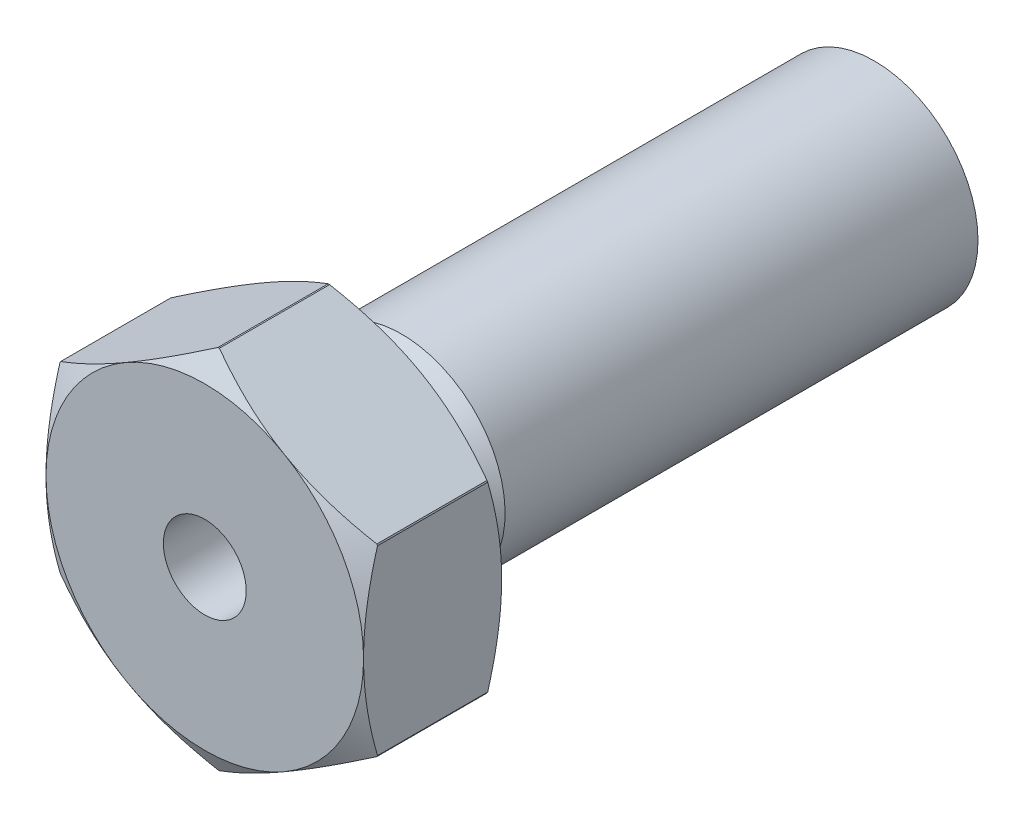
ISO-10303-21;
HEADER;
FILE_DESCRIPTION(('STEP AP214'),'2;1');
FILE_NAME('part.step','',(''),(''),'','','');
FILE_SCHEMA(('AUTOMOTIVE_DESIGN { 1 0 10303 214 1 1 1 1 }'));
ENDSEC;
DATA;
#1=APPLICATION_CONTEXT('core data for automotive mechanical design processes');
#2=APPLICATION_PROTOCOL_DEFINITION('international standard','automotive_design',2000,#1);
#3=PRODUCT_CONTEXT('',#1,'mechanical');
#4=PRODUCT('Part','Part','',(#3));
#5=PRODUCT_RELATED_PRODUCT_CATEGORY('part','',(#4));
#6=PRODUCT_DEFINITION_FORMATION('','',#4);
#7=PRODUCT_DEFINITION_CONTEXT('part definition',#1,'design');
#8=PRODUCT_DEFINITION('design','',#6,#7);
#9=PRODUCT_DEFINITION_SHAPE('','',#8);
#10=(LENGTH_UNIT() NAMED_UNIT(*) SI_UNIT(.MILLI.,.METRE.));
#11=(NAMED_UNIT(*) PLANE_ANGLE_UNIT() SI_UNIT($,.RADIAN.));
#12=(NAMED_UNIT(*) SI_UNIT($,.STERADIAN.) SOLID_ANGLE_UNIT());
#13=UNCERTAINTY_MEASURE_WITH_UNIT(LENGTH_MEASURE(1.E-05),#10,'distance_accuracy_value','');
#14=(GEOMETRIC_REPRESENTATION_CONTEXT(3) GLOBAL_UNCERTAINTY_ASSIGNED_CONTEXT((#13)) GLOBAL_UNIT_ASSIGNED_CONTEXT((#10,
#11,#12)) REPRESENTATION_CONTEXT('',''));
#15=CARTESIAN_POINT('',(0.,0.,0.));
#16=DIRECTION('',(0.,0.,1.));
#17=DIRECTION('',(1.,0.,0.));
#18=AXIS2_PLACEMENT_3D('',#15,#16,#17);
#19=CARTESIAN_POINT('',(0.,0.,9.));
#20=DIRECTION('',(0.,0.,-1.));
#21=DIRECTION('',(0.,-1.,0.));
#22=AXIS2_PLACEMENT_3D('',#19,#20,#21);
#23=CYLINDRICAL_SURFACE('',#22,6.);
#24=CARTESIAN_POINT('',(0.,0.,9.));
#25=DIRECTION('',(0.,0.,1.));
#26=DIRECTION('',(1.,0.,0.));
#27=AXIS2_PLACEMENT_3D('',#24,#25,#26);
#28=CIRCLE('',#27,6.);
#29=CARTESIAN_POINT('',(6.,0.,9.));
#30=VERTEX_POINT('',#29);
#31=EDGE_CURVE('E792',#30,#30,#28,.T.);
#32=ORIENTED_EDGE('',*,*,#31,.F.);
#33=EDGE_LOOP('',(#32));
#34=FACE_BOUND('',#33,.T.);
#35=CARTESIAN_POINT('',(0.,0.,20.));
#36=DIRECTION('',(0.,0.,-1.));
#37=DIRECTION('',(0.,-1.,0.));
#38=AXIS2_PLACEMENT_3D('',#35,#36,#37);
#39=CIRCLE('',#38,6.);
#40=CARTESIAN_POINT('',(0.,-6.,20.));
#41=VERTEX_POINT('',#40);
#42=EDGE_CURVE('E17',#41,#41,#39,.T.);
#43=ORIENTED_EDGE('',*,*,#42,.F.);
#44=EDGE_LOOP('',(#43));
#45=FACE_BOUND('',#44,.T.);
#46=ADVANCED_FACE('F14',(#34,#45),#23,.F.);
#47=CARTESIAN_POINT('',(-11.5,0.,20.));
#48=DIRECTION('',(0.,0.,1.));
#49=DIRECTION('',(0.,1.,0.));
#50=AXIS2_PLACEMENT_3D('',#47,#48,#49);
#51=PLANE('',#50);
#52=CARTESIAN_POINT('',(0.,0.,20.));
#53=DIRECTION('',(0.,0.,-1.));
#54=DIRECTION('',(0.,-1.,0.));
#55=AXIS2_PLACEMENT_3D('',#52,#53,#54);
#56=CIRCLE('',#55,23.);
#57=CARTESIAN_POINT('',(-11.5,19.9185842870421,20.));
#58=VERTEX_POINT('',#57);
#59=CARTESIAN_POINT('',(11.5,19.9185842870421,20.));
#60=VERTEX_POINT('',#59);
#61=EDGE_CURVE('E140',#58,#60,#56,.T.);
#62=ORIENTED_EDGE('',*,*,#61,.F.);
#63=CARTESIAN_POINT('',(0.,0.,20.));
#64=DIRECTION('',(0.,0.,-1.));
#65=DIRECTION('',(0.,-1.,0.));
#66=AXIS2_PLACEMENT_3D('',#63,#64,#65);
#67=CIRCLE('',#66,23.);
#68=CARTESIAN_POINT('',(-23.,0.,20.));
#69=VERTEX_POINT('',#68);
#70=EDGE_CURVE('E132',#69,#58,#67,.T.);
#71=ORIENTED_EDGE('',*,*,#70,.F.);
#72=CARTESIAN_POINT('',(0.,0.,20.));
#73=DIRECTION('',(0.,0.,-1.));
#74=DIRECTION('',(0.,-1.,0.));
#75=AXIS2_PLACEMENT_3D('',#72,#73,#74);
#76=CIRCLE('',#75,23.);
#77=CARTESIAN_POINT('',(-11.5,-19.9185842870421,20.));
#78=VERTEX_POINT('',#77);
#79=EDGE_CURVE('E137',#78,#69,#76,.T.);
#80=ORIENTED_EDGE('',*,*,#79,.F.);
#81=CARTESIAN_POINT('',(0.,0.,20.));
#82=DIRECTION('',(0.,0.,-1.));
#83=DIRECTION('',(0.,-1.,0.));
#84=AXIS2_PLACEMENT_3D('',#81,#82,#83);
#85=CIRCLE('',#84,23.);
#86=CARTESIAN_POINT('',(11.5,-19.9185842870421,20.));
#87=VERTEX_POINT('',#86);
#88=EDGE_CURVE('E444',#87,#78,#85,.T.);
#89=ORIENTED_EDGE('',*,*,#88,.F.);
#90=CARTESIAN_POINT('',(0.,0.,20.));
#91=DIRECTION('',(0.,0.,-1.));
#92=DIRECTION('',(0.,-1.,0.));
#93=AXIS2_PLACEMENT_3D('',#90,#91,#92);
#94=CIRCLE('',#93,23.);
#95=CARTESIAN_POINT('',(23.,0.,20.));
#96=VERTEX_POINT('',#95);
#97=EDGE_CURVE('E439',#96,#87,#94,.T.);
#98=ORIENTED_EDGE('',*,*,#97,.F.);
#99=CARTESIAN_POINT('',(0.,0.,20.));
#100=DIRECTION('',(0.,0.,-1.));
#101=DIRECTION('',(0.,-1.,0.));
#102=AXIS2_PLACEMENT_3D('',#99,#100,#101);
#103=CIRCLE('',#102,23.);
#104=EDGE_CURVE('E454',#60,#96,#103,.T.);
#105=ORIENTED_EDGE('',*,*,#104,.F.);
#106=EDGE_LOOP('',(#62,#71,#80,#89,#98,#105));
#107=FACE_BOUND('',#106,.T.);
#108=ORIENTED_EDGE('',*,*,#42,.T.);
#109=EDGE_LOOP('',(#108));
#110=FACE_BOUND('',#109,.T.);
#111=ADVANCED_FACE('F134',(#107,#110),#51,.T.);
#112=CARTESIAN_POINT('',(0.,0.,17.9792740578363));
#113=DIRECTION('',(0.,0.,-1.));
#114=DIRECTION('',(0.,-1.,0.));
#115=AXIS2_PLACEMENT_3D('',#112,#113,#114);
#116=CONICAL_SURFACE('',#115,26.5,1.0471975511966);
#117=CARTESIAN_POINT('',(-11.5,19.9185842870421,20.));
#118=CARTESIAN_POINT('',(-11.7418459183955,19.7789544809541,20.000004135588));
#119=CARTESIAN_POINT('',(-11.9836844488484,19.6393289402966,19.9970629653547));
#120=CARTESIAN_POINT('',(-12.4672516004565,19.3601413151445,19.9853277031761));
#121=CARTESIAN_POINT('',(-12.7089802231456,19.220579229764,19.9765336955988));
#122=CARTESIAN_POINT('',(-13.4337536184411,18.8021311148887,19.9414344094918));
#123=CARTESIAN_POINT('',(-13.9165014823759,18.5234165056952,19.9064118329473));
#124=CARTESIAN_POINT('',(-14.8779742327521,17.968309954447,19.8141154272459));
#125=CARTESIAN_POINT('',(-15.3567072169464,17.6919133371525,19.756952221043));
#126=CARTESIAN_POINT('',(-16.3119349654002,17.1404123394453,19.6215488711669));
#127=CARTESIAN_POINT('',(-16.7884296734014,16.8653079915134,19.5433082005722));
#128=CARTESIAN_POINT('',(-17.7381215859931,16.3170031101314,19.367329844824));
#129=CARTESIAN_POINT('',(-18.2113219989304,16.0438007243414,19.269615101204));
#130=CARTESIAN_POINT('',(-19.1546987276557,15.4991419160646,19.0562654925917));
#131=CARTESIAN_POINT('',(-19.6248748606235,15.2276855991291,18.9406295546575));
#132=CARTESIAN_POINT('',(-20.5643681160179,14.6852689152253,18.6925219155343));
#133=CARTESIAN_POINT('',(-21.0336688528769,14.4143180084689,18.5599679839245));
#134=CARTESIAN_POINT('',(-21.968869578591,13.8743796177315,18.2801996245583));
#135=CARTESIAN_POINT('',(-22.4347703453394,13.6053916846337,18.1329886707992));
#136=CARTESIAN_POINT('',(-22.899013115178,13.337360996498,17.9792740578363));
#137=B_SPLINE_CURVE_WITH_KNOTS('',3,(#117,#118,#119,#120,#121,#122,#123,#124,#125,#126,#127,
#128,#129,#130,#131,#132,#133,#134,#135,#136),.UNSPECIFIED.,.F.,.F.,(4,2,2,2,2,2,2,2,2,4),(0.,
0.837746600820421,1.67548112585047,3.35055016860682,5.01735570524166,6.68420291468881,
8.34909797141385,10.0140927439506,11.6875126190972,13.3605368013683),.UNSPECIFIED.);
#138=CARTESIAN_POINT('',(-22.899013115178,13.337360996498,17.9792740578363));
#139=VERTEX_POINT('',#138);
#140=EDGE_CURVE('E417',#58,#139,#137,.T.);
#141=ORIENTED_EDGE('',*,*,#140,.T.);
#142=CARTESIAN_POINT('',(0.,0.,17.9792740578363));
#143=DIRECTION('',(0.,0.,-1.));
#144=DIRECTION('',(0.,-1.,0.));
#145=AXIS2_PLACEMENT_3D('',#142,#143,#144);
#146=CIRCLE('',#145,26.5);
#147=CARTESIAN_POINT('',(-23.,13.1624465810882,17.9792740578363));
#148=VERTEX_POINT('',#147);
#149=EDGE_CURVE('E144',#148,#139,#146,.T.);
#150=ORIENTED_EDGE('',*,*,#149,.F.);
#151=CARTESIAN_POINT('',(-23.,13.1624465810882,17.9792740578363));
#152=CARTESIAN_POINT('',(-23.,12.6263852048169,18.1329886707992));
#153=CARTESIAN_POINT('',(-23.,12.0884093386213,18.2801996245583));
#154=CARTESIAN_POINT('',(-23.,11.0085325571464,18.5599679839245));
#155=CARTESIAN_POINT('',(-23.,10.4666307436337,18.6925219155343));
#156=CARTESIAN_POINT('',(-23.,9.38179737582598,18.9406295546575));
#157=CARTESIAN_POINT('',(-23.,8.83888474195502,19.0562654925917));
#158=CARTESIAN_POINT('',(-23.,7.74956712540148,19.269615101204));
#159=CARTESIAN_POINT('',(-23.,7.20316235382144,19.367329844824));
#160=CARTESIAN_POINT('',(-23.,6.1065525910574,19.5433082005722));
#161=CARTESIAN_POINT('',(-23.,5.55634389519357,19.6215488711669));
#162=CARTESIAN_POINT('',(-23.,4.45334189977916,19.756952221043));
#163=CARTESIAN_POINT('',(-23.,3.90054866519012,19.8141154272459));
#164=CARTESIAN_POINT('',(-23.,2.7903355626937,19.9064118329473));
#165=CARTESIAN_POINT('',(-23.,2.23290634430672,19.9414344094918));
#166=CARTESIAN_POINT('',(-23.,1.39601011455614,19.9765336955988));
#167=CARTESIAN_POINT('',(-23.,1.11688594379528,19.9853277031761));
#168=CARTESIAN_POINT('',(-23.,0.558510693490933,19.9970629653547));
#169=CARTESIAN_POINT('',(-23.,0.279259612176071,20.000004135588));
#170=CARTESIAN_POINT('',(-23.,0.,20.));
#171=B_SPLINE_CURVE_WITH_KNOTS('',3,(#151,#152,#153,#154,#155,#156,#157,#158,#159,#160,#161,
#162,#163,#164,#165,#166,#167,#168,#169,#170),.UNSPECIFIED.,.F.,.F.,(4,2,2,2,2,2,2,2,2,4),(0.,
1.67302418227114,3.34644405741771,5.01143882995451,6.67633388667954,8.34318109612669,
10.0099866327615,11.6850556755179,12.5227902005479,13.3605368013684),.UNSPECIFIED.);
#172=EDGE_CURVE('E146',#148,#69,#171,.T.);
#173=ORIENTED_EDGE('',*,*,#172,.T.);
#174=ORIENTED_EDGE('',*,*,#70,.T.);
#175=EDGE_LOOP('',(#141,#150,#173,#174));
#176=FACE_BOUND('',#175,.T.);
#177=ADVANCED_FACE('F147',(#176),#116,.T.);
#178=CARTESIAN_POINT('',(0.,0.,10.));
#179=DIRECTION('',(0.,0.,-1.));
#180=DIRECTION('',(0.,-1.,0.));
#181=AXIS2_PLACEMENT_3D('',#178,#179,#180);
#182=CYLINDRICAL_SURFACE('',#181,26.5);
#183=DIRECTION('',(0.,0.,1.));
#184=VECTOR('',#183,1.);
#185=CARTESIAN_POINT('',(-22.899013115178,13.337360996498,20.));
#186=LINE('',#185,#184);
#187=CARTESIAN_POINT('',(-22.899013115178,13.337360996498,2.02072594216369));
#188=VERTEX_POINT('',#187);
#189=EDGE_CURVE('E422',#139,#188,#186,.F.);
#190=ORIENTED_EDGE('',*,*,#189,.T.);
#191=CARTESIAN_POINT('',(0.,0.,2.02072594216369));
#192=DIRECTION('',(0.,0.,-1.));
#193=DIRECTION('',(0.,-1.,0.));
#194=AXIS2_PLACEMENT_3D('',#191,#192,#193);
#195=CIRCLE('',#194,26.5);
#196=CARTESIAN_POINT('',(-23.,13.1624465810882,2.02072594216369));
#197=VERTEX_POINT('',#196);
#198=EDGE_CURVE('E461',#188,#197,#195,.F.);
#199=ORIENTED_EDGE('',*,*,#198,.T.);
#200=DIRECTION('',(0.,0.,1.));
#201=VECTOR('',#200,1.);
#202=CARTESIAN_POINT('',(-23.,13.1624465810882,20.));
#203=LINE('',#202,#201);
#204=EDGE_CURVE('E154',#197,#148,#203,.T.);
#205=ORIENTED_EDGE('',*,*,#204,.T.);
#206=ORIENTED_EDGE('',*,*,#149,.T.);
#207=EDGE_LOOP('',(#190,#199,#205,#206));
#208=FACE_BOUND('',#207,.T.);
#209=ADVANCED_FACE('F409',(#208),#182,.T.);
#210=CARTESIAN_POINT('',(0.,0.,17.9792740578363));
#211=DIRECTION('',(0.,0.,-1.));
#212=DIRECTION('',(0.,-1.,0.));
#213=AXIS2_PLACEMENT_3D('',#210,#211,#212);
#214=CONICAL_SURFACE('',#213,26.5,1.0471975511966);
#215=CARTESIAN_POINT('',(11.5,19.9185842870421,20.));
#216=CARTESIAN_POINT('',(11.2581540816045,20.0582140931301,20.000004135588));
#217=CARTESIAN_POINT('',(11.0163155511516,20.1978396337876,19.9970629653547));
#218=CARTESIAN_POINT('',(10.5327483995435,20.4770272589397,19.985327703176));
#219=CARTESIAN_POINT('',(10.2910197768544,20.6165893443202,19.9765336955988));
#220=CARTESIAN_POINT('',(9.56624638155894,21.0350374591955,19.9414344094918));
#221=CARTESIAN_POINT('',(9.08349851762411,21.313752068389,19.9064118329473));
#222=CARTESIAN_POINT('',(8.12202576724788,21.8688586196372,19.8141154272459));
#223=CARTESIAN_POINT('',(7.6432927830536,22.1452552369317,19.756952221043));
#224=CARTESIAN_POINT('',(6.68806503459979,22.6967562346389,19.6215488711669));
#225=CARTESIAN_POINT('',(6.2115703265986,22.9718605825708,19.5433082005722));
#226=CARTESIAN_POINT('',(5.26187841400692,23.5201654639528,19.367329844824));
#227=CARTESIAN_POINT('',(4.78867800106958,23.7933678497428,19.269615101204));
#228=CARTESIAN_POINT('',(3.84530127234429,24.3380266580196,19.0562654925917));
#229=CARTESIAN_POINT('',(3.37512513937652,24.6094829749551,18.9406295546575));
#230=CARTESIAN_POINT('',(2.43563188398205,25.1518996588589,18.6925219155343));
#231=CARTESIAN_POINT('',(1.96633114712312,25.4228505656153,18.5599679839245));
#232=CARTESIAN_POINT('',(1.03113042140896,25.9627889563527,18.2801996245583));
#233=CARTESIAN_POINT('',(0.565229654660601,26.2317768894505,18.1329886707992));
#234=CARTESIAN_POINT('',(0.10098688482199,26.4998075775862,17.9792740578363));
#235=B_SPLINE_CURVE_WITH_KNOTS('',3,(#215,#216,#217,#218,#219,#220,#221,#222,#223,#224,#225,
#226,#227,#228,#229,#230,#231,#232,#233,#234),.UNSPECIFIED.,.F.,.F.,(4,2,2,2,2,2,2,2,2,4),(0.,
0.837746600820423,1.67548112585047,3.35055016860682,5.01735570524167,6.68420291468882,
8.34909797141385,10.0140927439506,11.6875126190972,13.3605368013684),.UNSPECIFIED.);
#236=CARTESIAN_POINT('',(0.100986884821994,26.4998075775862,17.9792740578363));
#237=VERTEX_POINT('',#236);
#238=EDGE_CURVE('E387',#60,#237,#235,.T.);
#239=ORIENTED_EDGE('',*,*,#238,.T.);
#240=CARTESIAN_POINT('',(0.,0.,17.9792740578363));
#241=DIRECTION('',(0.,0.,-1.));
#242=DIRECTION('',(0.,-1.,0.));
#243=AXIS2_PLACEMENT_3D('',#240,#241,#242);
#244=CIRCLE('',#243,26.5);
#245=CARTESIAN_POINT('',(-0.100986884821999,26.4998075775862,17.9792740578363));
#246=VERTEX_POINT('',#245);
#247=EDGE_CURVE('E456',#246,#237,#244,.T.);
#248=ORIENTED_EDGE('',*,*,#247,.F.);
#249=CARTESIAN_POINT('',(-0.100986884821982,26.4998075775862,17.9792740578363));
#250=CARTESIAN_POINT('',(-0.565229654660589,26.2317768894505,18.1329886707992));
#251=CARTESIAN_POINT('',(-1.03113042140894,25.9627889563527,18.2801996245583));
#252=CARTESIAN_POINT('',(-1.9663311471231,25.4228505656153,18.5599679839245));
#253=CARTESIAN_POINT('',(-2.43563188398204,25.1518996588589,18.6925219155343));
#254=CARTESIAN_POINT('',(-3.37512513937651,24.6094829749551,18.9406295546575));
#255=CARTESIAN_POINT('',(-3.84530127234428,24.3380266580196,19.0562654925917));
#256=CARTESIAN_POINT('',(-4.78867800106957,23.7933678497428,19.269615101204));
#257=CARTESIAN_POINT('',(-5.26187841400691,23.5201654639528,19.367329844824));
#258=CARTESIAN_POINT('',(-6.2115703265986,22.9718605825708,19.5433082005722));
#259=CARTESIAN_POINT('',(-6.68806503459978,22.6967562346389,19.6215488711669));
#260=CARTESIAN_POINT('',(-7.64329278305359,22.1452552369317,19.756952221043));
#261=CARTESIAN_POINT('',(-8.12202576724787,21.8688586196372,19.8141154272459));
#262=CARTESIAN_POINT('',(-9.08349851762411,21.3137520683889,19.9064118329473));
#263=CARTESIAN_POINT('',(-9.56624638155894,21.0350374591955,19.9414344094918));
#264=CARTESIAN_POINT('',(-10.2910197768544,20.6165893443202,19.9765336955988));
#265=CARTESIAN_POINT('',(-10.5327483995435,20.4770272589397,19.9853277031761));
#266=CARTESIAN_POINT('',(-11.0163155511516,20.1978396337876,19.9970629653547));
#267=CARTESIAN_POINT('',(-11.2581540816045,20.0582140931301,20.000004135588));
#268=CARTESIAN_POINT('',(-11.5,19.9185842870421,20.));
#269=B_SPLINE_CURVE_WITH_KNOTS('',3,(#249,#250,#251,#252,#253,#254,#255,#256,#257,#258,#259,
#260,#261,#262,#263,#264,#265,#266,#267,#268),.UNSPECIFIED.,.F.,.F.,(4,2,2,2,2,2,2,2,2,4),(0.,
1.67302418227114,3.34644405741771,5.01143882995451,6.67633388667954,8.34318109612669,
10.0099866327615,11.6850556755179,12.5227902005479,13.3605368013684),.UNSPECIFIED.);
#270=EDGE_CURVE('E181',#246,#58,#269,.T.);
#271=ORIENTED_EDGE('',*,*,#270,.T.);
#272=ORIENTED_EDGE('',*,*,#61,.T.);
#273=EDGE_LOOP('',(#239,#248,#271,#272));
#274=FACE_BOUND('',#273,.T.);
#275=ADVANCED_FACE('F403',(#274),#214,.T.);
#276=CARTESIAN_POINT('',(0.,0.,10.));
#277=DIRECTION('',(0.,0.,-1.));
#278=DIRECTION('',(0.,-1.,0.));
#279=AXIS2_PLACEMENT_3D('',#276,#277,#278);
#280=CYLINDRICAL_SURFACE('',#279,26.5);
#281=DIRECTION('',(0.,0.,1.));
#282=VECTOR('',#281,1.);
#283=CARTESIAN_POINT('',(0.100986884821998,26.4998075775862,20.));
#284=LINE('',#283,#282);
#285=CARTESIAN_POINT('',(0.100986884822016,26.4998075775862,2.02072594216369));
#286=VERTEX_POINT('',#285);
#287=EDGE_CURVE('E392',#237,#286,#284,.F.);
#288=ORIENTED_EDGE('',*,*,#287,.T.);
#289=CARTESIAN_POINT('',(0.,0.,2.02072594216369));
#290=DIRECTION('',(0.,0.,-1.));
#291=DIRECTION('',(0.,-1.,0.));
#292=AXIS2_PLACEMENT_3D('',#289,#290,#291);
#293=CIRCLE('',#292,26.5);
#294=CARTESIAN_POINT('',(-0.100986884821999,26.4998075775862,2.02072594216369));
#295=VERTEX_POINT('',#294);
#296=EDGE_CURVE('E458',#286,#295,#293,.F.);
#297=ORIENTED_EDGE('',*,*,#296,.T.);
#298=DIRECTION('',(0.,0.,1.));
#299=VECTOR('',#298,1.);
#300=CARTESIAN_POINT('',(-0.100986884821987,26.4998075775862,20.));
#301=LINE('',#300,#299);
#302=EDGE_CURVE('E172',#295,#246,#301,.T.);
#303=ORIENTED_EDGE('',*,*,#302,.T.);
#304=ORIENTED_EDGE('',*,*,#247,.T.);
#305=EDGE_LOOP('',(#288,#297,#303,#304));
#306=FACE_BOUND('',#305,.T.);
#307=ADVANCED_FACE('F408',(#306),#280,.T.);
#308=CARTESIAN_POINT('',(0.,0.,17.9792740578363));
#309=DIRECTION('',(0.,0.,-1.));
#310=DIRECTION('',(0.,-1.,0.));
#311=AXIS2_PLACEMENT_3D('',#308,#309,#310);
#312=CONICAL_SURFACE('',#311,26.5,1.0471975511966);
#313=CARTESIAN_POINT('',(23.,0.,20.));
#314=CARTESIAN_POINT('',(23.,0.279259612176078,20.000004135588));
#315=CARTESIAN_POINT('',(23.,0.55851069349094,19.9970629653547));
#316=CARTESIAN_POINT('',(23.,1.11688594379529,19.9853277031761));
#317=CARTESIAN_POINT('',(23.,1.39601011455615,19.9765336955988));
#318=CARTESIAN_POINT('',(23.,2.23290634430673,19.9414344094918));
#319=CARTESIAN_POINT('',(23.,2.79033556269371,19.9064118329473));
#320=CARTESIAN_POINT('',(23.,3.90054866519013,19.8141154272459));
#321=CARTESIAN_POINT('',(23.,4.45334189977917,19.756952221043));
#322=CARTESIAN_POINT('',(23.,5.55634389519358,19.6215488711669));
#323=CARTESIAN_POINT('',(23.,6.10655259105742,19.5433082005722));
#324=CARTESIAN_POINT('',(23.,7.20316235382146,19.367329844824));
#325=CARTESIAN_POINT('',(23.,7.74956712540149,19.269615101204));
#326=CARTESIAN_POINT('',(23.,8.83888474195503,19.0562654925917));
#327=CARTESIAN_POINT('',(23.,9.381797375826,18.9406295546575));
#328=CARTESIAN_POINT('',(23.,10.4666307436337,18.6925219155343));
#329=CARTESIAN_POINT('',(23.,11.0085325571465,18.5599679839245));
#330=CARTESIAN_POINT('',(23.,12.0884093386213,18.2801996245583));
#331=CARTESIAN_POINT('',(23.,12.6263852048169,18.1329886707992));
#332=CARTESIAN_POINT('',(23.,13.1624465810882,17.9792740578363));
#333=B_SPLINE_CURVE_WITH_KNOTS('',3,(#313,#314,#315,#316,#317,#318,#319,#320,#321,#322,#323,
#324,#325,#326,#327,#328,#329,#330,#331,#332),.UNSPECIFIED.,.F.,.F.,(4,2,2,2,2,2,2,2,2,4),(0.,
0.837746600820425,1.67548112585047,3.35055016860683,5.01735570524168,6.68420291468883,
8.34909797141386,10.0140927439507,11.6875126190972,13.3605368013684),.UNSPECIFIED.);
#334=CARTESIAN_POINT('',(23.,13.1624465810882,17.9792740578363));
#335=VERTEX_POINT('',#334);
#336=EDGE_CURVE('E221',#96,#335,#333,.T.);
#337=ORIENTED_EDGE('',*,*,#336,.T.);
#338=CARTESIAN_POINT('',(0.,0.,17.9792740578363));
#339=DIRECTION('',(0.,0.,-1.));
#340=DIRECTION('',(0.,-1.,0.));
#341=AXIS2_PLACEMENT_3D('',#338,#339,#340);
#342=CIRCLE('',#341,26.5);
#343=CARTESIAN_POINT('',(22.899013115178,13.337360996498,17.9792740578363));
#344=VERTEX_POINT('',#343);
#345=EDGE_CURVE('E451',#344,#335,#342,.T.);
#346=ORIENTED_EDGE('',*,*,#345,.F.);
#347=CARTESIAN_POINT('',(22.899013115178,13.337360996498,17.9792740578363));
#348=CARTESIAN_POINT('',(22.4347703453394,13.6053916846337,18.1329886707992));
#349=CARTESIAN_POINT('',(21.968869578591,13.8743796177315,18.2801996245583));
#350=CARTESIAN_POINT('',(21.0336688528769,14.4143180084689,18.5599679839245));
#351=CARTESIAN_POINT('',(20.5643681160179,14.6852689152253,18.6925219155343));
#352=CARTESIAN_POINT('',(19.6248748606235,15.2276855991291,18.9406295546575));
#353=CARTESIAN_POINT('',(19.1546987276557,15.4991419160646,19.0562654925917));
#354=CARTESIAN_POINT('',(18.2113219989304,16.0438007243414,19.269615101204));
#355=CARTESIAN_POINT('',(17.7381215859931,16.3170031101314,19.367329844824));
#356=CARTESIAN_POINT('',(16.7884296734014,16.8653079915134,19.5433082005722));
#357=CARTESIAN_POINT('',(16.3119349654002,17.1404123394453,19.6215488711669));
#358=CARTESIAN_POINT('',(15.3567072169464,17.6919133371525,19.756952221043));
#359=CARTESIAN_POINT('',(14.8779742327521,17.968309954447,19.8141154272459));
#360=CARTESIAN_POINT('',(13.9165014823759,18.5234165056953,19.9064118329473));
#361=CARTESIAN_POINT('',(13.4337536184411,18.8021311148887,19.9414344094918));
#362=CARTESIAN_POINT('',(12.7089802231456,19.220579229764,19.9765336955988));
#363=CARTESIAN_POINT('',(12.4672516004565,19.3601413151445,19.985327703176));
#364=CARTESIAN_POINT('',(11.9836844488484,19.6393289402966,19.9970629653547));
#365=CARTESIAN_POINT('',(11.7418459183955,19.7789544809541,20.000004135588));
#366=CARTESIAN_POINT('',(11.5,19.9185842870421,20.));
#367=B_SPLINE_CURVE_WITH_KNOTS('',3,(#347,#348,#349,#350,#351,#352,#353,#354,#355,#356,#357,
#358,#359,#360,#361,#362,#363,#364,#365,#366),.UNSPECIFIED.,.F.,.F.,(4,2,2,2,2,2,2,2,2,4),(0.,
1.67302418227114,3.34644405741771,5.01143882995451,6.67633388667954,8.34318109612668,
10.0099866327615,11.6850556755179,12.5227902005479,13.3605368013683),.UNSPECIFIED.);
#368=EDGE_CURVE('E393',#344,#60,#367,.T.);
#369=ORIENTED_EDGE('',*,*,#368,.T.);
#370=ORIENTED_EDGE('',*,*,#104,.T.);
#371=EDGE_LOOP('',(#337,#346,#369,#370));
#372=FACE_BOUND('',#371,.T.);
#373=ADVANCED_FACE('F524',(#372),#312,.T.);
#374=CARTESIAN_POINT('',(0.,0.,10.));
#375=DIRECTION('',(0.,0.,-1.));
#376=DIRECTION('',(0.,-1.,0.));
#377=AXIS2_PLACEMENT_3D('',#374,#375,#376);
#378=CYLINDRICAL_SURFACE('',#377,26.5);
#379=DIRECTION('',(0.,0.,1.));
#380=VECTOR('',#379,1.);
#381=CARTESIAN_POINT('',(23.,13.1624465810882,20.));
#382=LINE('',#381,#380);
#383=CARTESIAN_POINT('',(23.,13.1624465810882,2.02072594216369));
#384=VERTEX_POINT('',#383);
#385=EDGE_CURVE('E512',#335,#384,#382,.F.);
#386=ORIENTED_EDGE('',*,*,#385,.T.);
#387=CARTESIAN_POINT('',(0.,0.,2.02072594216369));
#388=DIRECTION('',(0.,0.,-1.));
#389=DIRECTION('',(0.,-1.,0.));
#390=AXIS2_PLACEMENT_3D('',#387,#388,#389);
#391=CIRCLE('',#390,26.5);
#392=CARTESIAN_POINT('',(22.899013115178,13.337360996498,2.02072594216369));
#393=VERTEX_POINT('',#392);
#394=EDGE_CURVE('E450',#384,#393,#391,.F.);
#395=ORIENTED_EDGE('',*,*,#394,.T.);
#396=DIRECTION('',(0.,0.,1.));
#397=VECTOR('',#396,1.);
#398=CARTESIAN_POINT('',(22.899013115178,13.337360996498,20.));
#399=LINE('',#398,#397);
#400=EDGE_CURVE('E424',#393,#344,#399,.T.);
#401=ORIENTED_EDGE('',*,*,#400,.T.);
#402=ORIENTED_EDGE('',*,*,#345,.T.);
#403=EDGE_LOOP('',(#386,#395,#401,#402));
#404=FACE_BOUND('',#403,.T.);
#405=ADVANCED_FACE('F697',(#404),#378,.T.);
#406=CARTESIAN_POINT('',(0.,0.,10.));
#407=DIRECTION('',(0.,0.,-1.));
#408=DIRECTION('',(0.,-1.,0.));
#409=AXIS2_PLACEMENT_3D('',#406,#407,#408);
#410=CYLINDRICAL_SURFACE('',#409,26.5);
#411=DIRECTION('',(0.,0.,1.));
#412=VECTOR('',#411,1.);
#413=CARTESIAN_POINT('',(-23.,-13.1624465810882,20.));
#414=LINE('',#413,#412);
#415=CARTESIAN_POINT('',(-23.,-13.1624465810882,17.9792740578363));
#416=VERTEX_POINT('',#415);
#417=CARTESIAN_POINT('',(-23.,-13.1624465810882,2.02072594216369));
#418=VERTEX_POINT('',#417);
#419=EDGE_CURVE('E170',#416,#418,#414,.F.);
#420=ORIENTED_EDGE('',*,*,#419,.T.);
#421=CARTESIAN_POINT('',(0.,0.,2.02072594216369));
#422=DIRECTION('',(0.,0.,-1.));
#423=DIRECTION('',(0.,-1.,0.));
#424=AXIS2_PLACEMENT_3D('',#421,#422,#423);
#425=CIRCLE('',#424,26.5);
#426=CARTESIAN_POINT('',(-22.899013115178,-13.337360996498,2.02072594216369));
#427=VERTEX_POINT('',#426);
#428=EDGE_CURVE('E165',#418,#427,#425,.F.);
#429=ORIENTED_EDGE('',*,*,#428,.T.);
#430=DIRECTION('',(0.,0.,1.));
#431=VECTOR('',#430,1.);
#432=CARTESIAN_POINT('',(-22.899013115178,-13.337360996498,20.));
#433=LINE('',#432,#431);
#434=CARTESIAN_POINT('',(-22.899013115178,-13.337360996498,17.9792740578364));
#435=VERTEX_POINT('',#434);
#436=EDGE_CURVE('E215',#427,#435,#433,.T.);
#437=ORIENTED_EDGE('',*,*,#436,.T.);
#438=CARTESIAN_POINT('',(0.,0.,17.9792740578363));
#439=DIRECTION('',(0.,0.,-1.));
#440=DIRECTION('',(-1.,0.,0.));
#441=AXIS2_PLACEMENT_3D('',#438,#439,#440);
#442=CIRCLE('',#441,26.5);
#443=EDGE_CURVE('E164',#416,#435,#442,.F.);
#444=ORIENTED_EDGE('',*,*,#443,.F.);
#445=EDGE_LOOP('',(#420,#429,#437,#444));
#446=FACE_BOUND('',#445,.T.);
#447=ADVANCED_FACE('F202',(#446),#410,.T.);
#448=CARTESIAN_POINT('',(0.,0.,17.9792740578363));
#449=DIRECTION('',(0.,0.,-1.));
#450=DIRECTION('',(0.,-1.,0.));
#451=AXIS2_PLACEMENT_3D('',#448,#449,#450);
#452=CONICAL_SURFACE('',#451,26.5,1.0471975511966);
#453=CARTESIAN_POINT('',(-23.,0.,20.));
#454=CARTESIAN_POINT('',(-23.,-0.27925961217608,20.000004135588));
#455=CARTESIAN_POINT('',(-23.,-0.558510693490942,19.9970629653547));
#456=CARTESIAN_POINT('',(-23.,-1.11688594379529,19.9853277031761));
#457=CARTESIAN_POINT('',(-23.,-1.39601011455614,19.9765336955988));
#458=CARTESIAN_POINT('',(-23.,-2.23290634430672,19.9414344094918));
#459=CARTESIAN_POINT('',(-23.,-2.7903355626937,19.9064118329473));
#460=CARTESIAN_POINT('',(-23.,-3.90054866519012,19.8141154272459));
#461=CARTESIAN_POINT('',(-23.,-4.45334189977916,19.756952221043));
#462=CARTESIAN_POINT('',(-23.,-5.55634389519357,19.6215488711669));
#463=CARTESIAN_POINT('',(-23.,-6.1065525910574,19.5433082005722));
#464=CARTESIAN_POINT('',(-23.,-7.20316235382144,19.367329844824));
#465=CARTESIAN_POINT('',(-23.,-7.74956712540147,19.269615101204));
#466=CARTESIAN_POINT('',(-23.,-8.83888474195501,19.0562654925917));
#467=CARTESIAN_POINT('',(-23.,-9.38179737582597,18.9406295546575));
#468=CARTESIAN_POINT('',(-23.,-10.4666307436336,18.6925219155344));
#469=CARTESIAN_POINT('',(-23.,-11.0085325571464,18.5599679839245));
#470=CARTESIAN_POINT('',(-23.,-12.0884093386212,18.2801996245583));
#471=CARTESIAN_POINT('',(-23.,-12.6263852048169,18.1329886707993));
#472=CARTESIAN_POINT('',(-23.,-13.1624465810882,17.9792740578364));
#473=B_SPLINE_CURVE_WITH_KNOTS('',3,(#453,#454,#455,#456,#457,#458,#459,#460,#461,#462,#463,
#464,#465,#466,#467,#468,#469,#470,#471,#472),.UNSPECIFIED.,.F.,.F.,(4,2,2,2,2,2,2,2,2,4),(0.,
0.837746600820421,1.67548112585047,3.35055016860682,5.01735570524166,6.68420291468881,
8.34909797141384,10.0140927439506,11.6875126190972,13.3605368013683),.UNSPECIFIED.);
#474=EDGE_CURVE('E153',#69,#416,#473,.T.);
#475=ORIENTED_EDGE('',*,*,#474,.T.);
#476=ORIENTED_EDGE('',*,*,#443,.T.);
#477=CARTESIAN_POINT('',(-22.899013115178,-13.337360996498,17.9792740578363));
#478=CARTESIAN_POINT('',(-22.4347703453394,-13.6053916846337,18.1329886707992));
#479=CARTESIAN_POINT('',(-21.968869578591,-13.8743796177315,18.2801996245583));
#480=CARTESIAN_POINT('',(-21.0336688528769,-14.4143180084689,18.5599679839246));
#481=CARTESIAN_POINT('',(-20.564368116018,-14.6852689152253,18.6925219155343));
#482=CARTESIAN_POINT('',(-19.6248748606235,-15.2276855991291,18.9406295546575));
#483=CARTESIAN_POINT('',(-19.1546987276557,-15.4991419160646,19.0562654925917));
#484=CARTESIAN_POINT('',(-18.2113219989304,-16.0438007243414,19.269615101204));
#485=CARTESIAN_POINT('',(-17.7381215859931,-16.3170031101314,19.367329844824));
#486=CARTESIAN_POINT('',(-16.7884296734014,-16.8653079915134,19.5433082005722));
#487=CARTESIAN_POINT('',(-16.3119349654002,-17.1404123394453,19.6215488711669));
#488=CARTESIAN_POINT('',(-15.3567072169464,-17.6919133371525,19.756952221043));
#489=CARTESIAN_POINT('',(-14.8779742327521,-17.968309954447,19.8141154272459));
#490=CARTESIAN_POINT('',(-13.9165014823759,-18.5234165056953,19.9064118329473));
#491=CARTESIAN_POINT('',(-13.4337536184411,-18.8021311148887,19.9414344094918));
#492=CARTESIAN_POINT('',(-12.7089802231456,-19.220579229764,19.9765336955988));
#493=CARTESIAN_POINT('',(-12.4672516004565,-19.3601413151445,19.9853277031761));
#494=CARTESIAN_POINT('',(-11.9836844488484,-19.6393289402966,19.9970629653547));
#495=CARTESIAN_POINT('',(-11.7418459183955,-19.7789544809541,20.000004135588));
#496=CARTESIAN_POINT('',(-11.5,-19.9185842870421,20.));
#497=B_SPLINE_CURVE_WITH_KNOTS('',3,(#477,#478,#479,#480,#481,#482,#483,#484,#485,#486,#487,
#488,#489,#490,#491,#492,#493,#494,#495,#496),.UNSPECIFIED.,.F.,.F.,(4,2,2,2,2,2,2,2,2,4),(0.,
1.67302418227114,3.34644405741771,5.01143882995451,6.67633388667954,8.34318109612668,
10.0099866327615,11.6850556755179,12.5227902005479,13.3605368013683),.UNSPECIFIED.);
#498=EDGE_CURVE('E162',#435,#78,#497,.T.);
#499=ORIENTED_EDGE('',*,*,#498,.T.);
#500=ORIENTED_EDGE('',*,*,#79,.T.);
#501=EDGE_LOOP('',(#475,#476,#499,#500));
#502=FACE_BOUND('',#501,.T.);
#503=ADVANCED_FACE('F158',(#502),#452,.T.);
#504=CARTESIAN_POINT('',(0.,0.,10.));
#505=DIRECTION('',(0.,0.,-1.));
#506=DIRECTION('',(0.,-1.,0.));
#507=AXIS2_PLACEMENT_3D('',#504,#505,#506);
#508=CYLINDRICAL_SURFACE('',#507,26.5);
#509=DIRECTION('',(0.,0.,1.));
#510=VECTOR('',#509,1.);
#511=CARTESIAN_POINT('',(0.100986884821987,-26.4998075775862,20.));
#512=LINE('',#511,#510);
#513=CARTESIAN_POINT('',(0.100986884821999,-26.4998075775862,2.02072594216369));
#514=VERTEX_POINT('',#513);
#515=CARTESIAN_POINT('',(0.100986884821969,-26.4998075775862,17.9792740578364));
#516=VERTEX_POINT('',#515);
#517=EDGE_CURVE('E502',#514,#516,#512,.T.);
#518=ORIENTED_EDGE('',*,*,#517,.T.);
#519=CARTESIAN_POINT('',(0.,0.,17.9792740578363));
#520=DIRECTION('',(0.,0.,-1.));
#521=DIRECTION('',(-1.,0.,0.));
#522=AXIS2_PLACEMENT_3D('',#519,#520,#521);
#523=CIRCLE('',#522,26.5);
#524=CARTESIAN_POINT('',(-0.100986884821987,-26.4998075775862,17.9792740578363));
#525=VERTEX_POINT('',#524);
#526=EDGE_CURVE('E441',#525,#516,#523,.F.);
#527=ORIENTED_EDGE('',*,*,#526,.F.);
#528=DIRECTION('',(0.,0.,1.));
#529=VECTOR('',#528,1.);
#530=CARTESIAN_POINT('',(-0.100986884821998,-26.4998075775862,20.));
#531=LINE('',#530,#529);
#532=CARTESIAN_POINT('',(-0.100986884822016,-26.4998075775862,2.02072594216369));
#533=VERTEX_POINT('',#532);
#534=EDGE_CURVE('E498',#525,#533,#531,.F.);
#535=ORIENTED_EDGE('',*,*,#534,.T.);
#536=CARTESIAN_POINT('',(0.,0.,2.02072594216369));
#537=DIRECTION('',(0.,0.,-1.));
#538=DIRECTION('',(0.,-1.,0.));
#539=AXIS2_PLACEMENT_3D('',#536,#537,#538);
#540=CIRCLE('',#539,26.5);
#541=EDGE_CURVE('E445',#533,#514,#540,.F.);
#542=ORIENTED_EDGE('',*,*,#541,.T.);
#543=EDGE_LOOP('',(#518,#527,#535,#542));
#544=FACE_BOUND('',#543,.T.);
#545=ADVANCED_FACE('F201',(#544),#508,.T.);
#546=CARTESIAN_POINT('',(0.,0.,17.9792740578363));
#547=DIRECTION('',(0.,0.,-1.));
#548=DIRECTION('',(0.,-1.,0.));
#549=AXIS2_PLACEMENT_3D('',#546,#547,#548);
#550=CONICAL_SURFACE('',#549,26.5,1.0471975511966);
#551=CARTESIAN_POINT('',(0.100986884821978,-26.4998075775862,17.9792740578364));
#552=CARTESIAN_POINT('',(0.565229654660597,-26.2317768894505,18.1329886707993));
#553=CARTESIAN_POINT('',(1.03113042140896,-25.9627889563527,18.2801996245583));
#554=CARTESIAN_POINT('',(1.96633114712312,-25.4228505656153,18.5599679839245));
#555=CARTESIAN_POINT('',(2.43563188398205,-25.1518996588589,18.6925219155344));
#556=CARTESIAN_POINT('',(3.37512513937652,-24.6094829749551,18.9406295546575));
#557=CARTESIAN_POINT('',(3.84530127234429,-24.3380266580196,19.0562654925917));
#558=CARTESIAN_POINT('',(4.78867800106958,-23.7933678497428,19.269615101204));
#559=CARTESIAN_POINT('',(5.26187841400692,-23.5201654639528,19.367329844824));
#560=CARTESIAN_POINT('',(6.2115703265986,-22.9718605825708,19.5433082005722));
#561=CARTESIAN_POINT('',(6.68806503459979,-22.6967562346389,19.6215488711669));
#562=CARTESIAN_POINT('',(7.64329278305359,-22.1452552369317,19.756952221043));
#563=CARTESIAN_POINT('',(8.12202576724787,-21.8688586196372,19.8141154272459));
#564=CARTESIAN_POINT('',(9.08349851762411,-21.3137520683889,19.9064118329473));
#565=CARTESIAN_POINT('',(9.56624638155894,-21.0350374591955,19.9414344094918));
#566=CARTESIAN_POINT('',(10.2910197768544,-20.6165893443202,19.9765336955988));
#567=CARTESIAN_POINT('',(10.5327483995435,-20.4770272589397,19.9853277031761));
#568=CARTESIAN_POINT('',(11.0163155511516,-20.1978396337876,19.9970629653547));
#569=CARTESIAN_POINT('',(11.2581540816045,-20.0582140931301,20.000004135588));
#570=CARTESIAN_POINT('',(11.5,-19.9185842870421,20.));
#571=B_SPLINE_CURVE_WITH_KNOTS('',3,(#551,#552,#553,#554,#555,#556,#557,#558,#559,#560,#561,
#562,#563,#564,#565,#566,#567,#568,#569,#570),.UNSPECIFIED.,.F.,.F.,(4,2,2,2,2,2,2,2,2,4),(0.,
1.67302418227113,3.3464440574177,5.0114388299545,6.67633388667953,8.34318109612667,
10.0099866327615,11.6850556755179,12.5227902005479,13.3605368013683),.UNSPECIFIED.);
#572=EDGE_CURVE('E506',#516,#87,#571,.T.);
#573=ORIENTED_EDGE('',*,*,#572,.T.);
#574=ORIENTED_EDGE('',*,*,#88,.T.);
#575=CARTESIAN_POINT('',(-11.5,-19.9185842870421,20.));
#576=CARTESIAN_POINT('',(-11.2581540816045,-20.0582140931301,20.000004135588));
#577=CARTESIAN_POINT('',(-11.0163155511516,-20.1978396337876,19.9970629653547));
#578=CARTESIAN_POINT('',(-10.5327483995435,-20.4770272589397,19.9853277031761));
#579=CARTESIAN_POINT('',(-10.2910197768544,-20.6165893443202,19.9765336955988));
#580=CARTESIAN_POINT('',(-9.56624638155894,-21.0350374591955,19.9414344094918));
#581=CARTESIAN_POINT('',(-9.08349851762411,-21.313752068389,19.9064118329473));
#582=CARTESIAN_POINT('',(-8.12202576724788,-21.8688586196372,19.8141154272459));
#583=CARTESIAN_POINT('',(-7.6432927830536,-22.1452552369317,19.756952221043));
#584=CARTESIAN_POINT('',(-6.68806503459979,-22.6967562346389,19.6215488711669));
#585=CARTESIAN_POINT('',(-6.21157032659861,-22.9718605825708,19.5433082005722));
#586=CARTESIAN_POINT('',(-5.26187841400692,-23.5201654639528,19.367329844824));
#587=CARTESIAN_POINT('',(-4.78867800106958,-23.7933678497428,19.269615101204));
#588=CARTESIAN_POINT('',(-3.8453012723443,-24.3380266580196,19.0562654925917));
#589=CARTESIAN_POINT('',(-3.37512513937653,-24.6094829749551,18.9406295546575));
#590=CARTESIAN_POINT('',(-2.43563188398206,-25.1518996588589,18.6925219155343));
#591=CARTESIAN_POINT('',(-1.96633114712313,-25.4228505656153,18.5599679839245));
#592=CARTESIAN_POINT('',(-1.03113042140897,-25.9627889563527,18.2801996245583));
#593=CARTESIAN_POINT('',(-0.565229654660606,-26.2317768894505,18.1329886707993));
#594=CARTESIAN_POINT('',(-0.100986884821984,-26.4998075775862,17.9792740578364));
#595=B_SPLINE_CURVE_WITH_KNOTS('',3,(#575,#576,#577,#578,#579,#580,#581,#582,#583,#584,#585,
#586,#587,#588,#589,#590,#591,#592,#593,#594),.UNSPECIFIED.,.F.,.F.,(4,2,2,2,2,2,2,2,2,4),(0.,
0.837746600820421,1.67548112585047,3.35055016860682,5.01735570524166,6.68420291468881,
8.34909797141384,10.0140927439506,11.6875126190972,13.3605368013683),.UNSPECIFIED.);
#596=EDGE_CURVE('E214',#78,#525,#595,.T.);
#597=ORIENTED_EDGE('',*,*,#596,.T.);
#598=ORIENTED_EDGE('',*,*,#526,.T.);
#599=EDGE_LOOP('',(#573,#574,#597,#598));
#600=FACE_BOUND('',#599,.T.);
#601=ADVANCED_FACE('F667',(#600),#550,.T.);
#602=CARTESIAN_POINT('',(0.,0.,17.9792740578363));
#603=DIRECTION('',(0.,0.,-1.));
#604=DIRECTION('',(0.,-1.,0.));
#605=AXIS2_PLACEMENT_3D('',#602,#603,#604);
#606=CONICAL_SURFACE('',#605,26.5,1.0471975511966);
#607=CARTESIAN_POINT('',(11.5,-19.9185842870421,20.));
#608=CARTESIAN_POINT('',(11.7418459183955,-19.7789544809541,20.000004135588));
#609=CARTESIAN_POINT('',(11.9836844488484,-19.6393289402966,19.9970629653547));
#610=CARTESIAN_POINT('',(12.4672516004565,-19.3601413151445,19.9853277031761));
#611=CARTESIAN_POINT('',(12.7089802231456,-19.220579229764,19.9765336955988));
#612=CARTESIAN_POINT('',(13.4337536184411,-18.8021311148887,19.9414344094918));
#613=CARTESIAN_POINT('',(13.9165014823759,-18.5234165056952,19.9064118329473));
#614=CARTESIAN_POINT('',(14.8779742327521,-17.968309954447,19.8141154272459));
#615=CARTESIAN_POINT('',(15.3567072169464,-17.6919133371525,19.756952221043));
#616=CARTESIAN_POINT('',(16.3119349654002,-17.1404123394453,19.6215488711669));
#617=CARTESIAN_POINT('',(16.7884296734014,-16.8653079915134,19.5433082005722));
#618=CARTESIAN_POINT('',(17.7381215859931,-16.3170031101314,19.367329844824));
#619=CARTESIAN_POINT('',(18.2113219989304,-16.0438007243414,19.269615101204));
#620=CARTESIAN_POINT('',(19.1546987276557,-15.4991419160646,19.0562654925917));
#621=CARTESIAN_POINT('',(19.6248748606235,-15.2276855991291,18.9406295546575));
#622=CARTESIAN_POINT('',(20.5643681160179,-14.6852689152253,18.6925219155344));
#623=CARTESIAN_POINT('',(21.0336688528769,-14.4143180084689,18.5599679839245));
#624=CARTESIAN_POINT('',(21.968869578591,-13.8743796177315,18.2801996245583));
#625=CARTESIAN_POINT('',(22.4347703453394,-13.6053916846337,18.1329886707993));
#626=CARTESIAN_POINT('',(22.899013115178,-13.337360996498,17.9792740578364));
#627=B_SPLINE_CURVE_WITH_KNOTS('',3,(#607,#608,#609,#610,#611,#612,#613,#614,#615,#616,#617,
#618,#619,#620,#621,#622,#623,#624,#625,#626),.UNSPECIFIED.,.F.,.F.,(4,2,2,2,2,2,2,2,2,4),(0.,
0.837746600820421,1.67548112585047,3.35055016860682,5.01735570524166,6.6842029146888,
8.34909797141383,10.0140927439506,11.6875126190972,13.3605368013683),.UNSPECIFIED.);
#628=CARTESIAN_POINT('',(22.899013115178,-13.337360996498,17.9792740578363));
#629=VERTEX_POINT('',#628);
#630=EDGE_CURVE('E268',#87,#629,#627,.T.);
#631=ORIENTED_EDGE('',*,*,#630,.T.);
#632=CARTESIAN_POINT('',(0.,0.,17.9792740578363));
#633=DIRECTION('',(0.,0.,-1.));
#634=DIRECTION('',(0.,-1.,0.));
#635=AXIS2_PLACEMENT_3D('',#632,#633,#634);
#636=CIRCLE('',#635,26.5);
#637=CARTESIAN_POINT('',(23.,-13.1624465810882,17.9792740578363));
#638=VERTEX_POINT('',#637);
#639=EDGE_CURVE('E436',#638,#629,#636,.T.);
#640=ORIENTED_EDGE('',*,*,#639,.F.);
#641=CARTESIAN_POINT('',(23.,-13.1624465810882,17.9792740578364));
#642=CARTESIAN_POINT('',(23.,-12.6263852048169,18.1329886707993));
#643=CARTESIAN_POINT('',(23.,-12.0884093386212,18.2801996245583));
#644=CARTESIAN_POINT('',(23.,-11.0085325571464,18.5599679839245));
#645=CARTESIAN_POINT('',(23.,-10.4666307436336,18.6925219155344));
#646=CARTESIAN_POINT('',(23.,-9.38179737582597,18.9406295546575));
#647=CARTESIAN_POINT('',(23.,-8.83888474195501,19.0562654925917));
#648=CARTESIAN_POINT('',(23.,-7.74956712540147,19.269615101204));
#649=CARTESIAN_POINT('',(23.,-7.20316235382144,19.367329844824));
#650=CARTESIAN_POINT('',(23.,-6.1065525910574,19.5433082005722));
#651=CARTESIAN_POINT('',(23.,-5.55634389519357,19.6215488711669));
#652=CARTESIAN_POINT('',(23.,-4.45334189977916,19.756952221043));
#653=CARTESIAN_POINT('',(23.,-3.90054866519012,19.8141154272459));
#654=CARTESIAN_POINT('',(23.,-2.7903355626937,19.9064118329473));
#655=CARTESIAN_POINT('',(23.,-2.23290634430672,19.9414344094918));
#656=CARTESIAN_POINT('',(23.,-1.39601011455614,19.9765336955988));
#657=CARTESIAN_POINT('',(23.,-1.11688594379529,19.9853277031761));
#658=CARTESIAN_POINT('',(23.,-0.558510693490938,19.9970629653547));
#659=CARTESIAN_POINT('',(23.,-0.279259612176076,20.000004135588));
#660=CARTESIAN_POINT('',(23.,0.,20.));
#661=B_SPLINE_CURVE_WITH_KNOTS('',3,(#641,#642,#643,#644,#645,#646,#647,#648,#649,#650,#651,
#652,#653,#654,#655,#656,#657,#658,#659,#660),.UNSPECIFIED.,.F.,.F.,(4,2,2,2,2,2,2,2,2,4),(0.,
1.67302418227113,3.3464440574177,5.0114388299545,6.67633388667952,8.34318109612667,
10.0099866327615,11.6850556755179,12.5227902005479,13.3605368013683),.UNSPECIFIED.);
#662=EDGE_CURVE('E394',#638,#96,#661,.T.);
#663=ORIENTED_EDGE('',*,*,#662,.T.);
#664=ORIENTED_EDGE('',*,*,#97,.T.);
#665=EDGE_LOOP('',(#631,#640,#663,#664));
#666=FACE_BOUND('',#665,.T.);
#667=ADVANCED_FACE('F656',(#666),#606,.T.);
#668=CARTESIAN_POINT('',(0.,0.,10.));
#669=DIRECTION('',(0.,0.,-1.));
#670=DIRECTION('',(0.,-1.,0.));
#671=AXIS2_PLACEMENT_3D('',#668,#669,#670);
#672=CYLINDRICAL_SURFACE('',#671,26.5);
#673=DIRECTION('',(0.,0.,1.));
#674=VECTOR('',#673,1.);
#675=CARTESIAN_POINT('',(22.899013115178,-13.337360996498,20.));
#676=LINE('',#675,#674);
#677=CARTESIAN_POINT('',(22.899013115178,-13.337360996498,2.02072594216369));
#678=VERTEX_POINT('',#677);
#679=EDGE_CURVE('E262',#629,#678,#676,.F.);
#680=ORIENTED_EDGE('',*,*,#679,.T.);
#681=CARTESIAN_POINT('',(0.,0.,2.02072594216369));
#682=DIRECTION('',(0.,0.,-1.));
#683=DIRECTION('',(0.,-1.,0.));
#684=AXIS2_PLACEMENT_3D('',#681,#682,#683);
#685=CIRCLE('',#684,26.5);
#686=CARTESIAN_POINT('',(23.,-13.1624465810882,2.02072594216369));
#687=VERTEX_POINT('',#686);
#688=EDGE_CURVE('E435',#678,#687,#685,.F.);
#689=ORIENTED_EDGE('',*,*,#688,.T.);
#690=DIRECTION('',(0.,0.,1.));
#691=VECTOR('',#690,1.);
#692=CARTESIAN_POINT('',(23.,-13.1624465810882,20.));
#693=LINE('',#692,#691);
#694=EDGE_CURVE('E514',#687,#638,#693,.T.);
#695=ORIENTED_EDGE('',*,*,#694,.T.);
#696=ORIENTED_EDGE('',*,*,#639,.T.);
#697=EDGE_LOOP('',(#680,#689,#695,#696));
#698=FACE_BOUND('',#697,.T.);
#699=ADVANCED_FACE('F540',(#698),#672,.T.);
#700=CARTESIAN_POINT('',(-23.,-13.2790561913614,20.));
#701=DIRECTION('',(1.,0.,0.));
#702=DIRECTION('',(0.,1.,0.));
#703=AXIS2_PLACEMENT_3D('',#700,#701,#702);
#704=PLANE('',#703);
#705=CARTESIAN_POINT('',(-23.,-13.1624465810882,2.0207259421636));
#706=CARTESIAN_POINT('',(-23.,-12.6263852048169,1.86701132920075));
#707=CARTESIAN_POINT('',(-23.,-12.0884093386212,1.71980037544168));
#708=CARTESIAN_POINT('',(-23.,-11.0085325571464,1.44003201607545));
#709=CARTESIAN_POINT('',(-23.,-10.4666307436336,1.30747808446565));
#710=CARTESIAN_POINT('',(-23.,-9.38179737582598,1.05937044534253));
#711=CARTESIAN_POINT('',(-23.,-8.83888474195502,0.943734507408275));
#712=CARTESIAN_POINT('',(-23.,-7.74956712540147,0.730384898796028));
#713=CARTESIAN_POINT('',(-23.,-7.20316235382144,0.632670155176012));
#714=CARTESIAN_POINT('',(-23.,-6.10655259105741,0.456691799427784));
#715=CARTESIAN_POINT('',(-23.,-5.55634389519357,0.378451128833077));
#716=CARTESIAN_POINT('',(-23.,-4.45334189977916,0.243047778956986));
#717=CARTESIAN_POINT('',(-23.,-3.90054866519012,0.185884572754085));
#718=CARTESIAN_POINT('',(-23.,-2.79033556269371,0.0935881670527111));
#719=CARTESIAN_POINT('',(-23.,-2.23290634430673,0.0585655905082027));
#720=CARTESIAN_POINT('',(-23.,-1.39601011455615,0.0234663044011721));
#721=CARTESIAN_POINT('',(-23.,-1.11688594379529,0.0146722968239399));
#722=CARTESIAN_POINT('',(-23.,-0.558510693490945,0.00293703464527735));
#723=CARTESIAN_POINT('',(-23.,-0.279259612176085,-4.13558795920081E-06));
#724=CARTESIAN_POINT('',(-23.,0.,0.));
#725=B_SPLINE_CURVE_WITH_KNOTS('',3,(#705,#706,#707,#708,#709,#710,#711,#712,#713,#714,#715,
#716,#717,#718,#719,#720,#721,#722,#723,#724),.UNSPECIFIED.,.F.,.F.,(4,2,2,2,2,2,2,2,2,4),(0.,
1.67302418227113,3.3464440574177,5.01143882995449,6.67633388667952,8.34318109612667,
10.0099866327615,11.6850556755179,12.5227902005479,13.3605368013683),.UNSPECIFIED.);
#726=CARTESIAN_POINT('',(-23.,0.,0.));
#727=VERTEX_POINT('',#726);
#728=EDGE_CURVE('E261',#418,#727,#725,.T.);
#729=ORIENTED_EDGE('',*,*,#728,.F.);
#730=ORIENTED_EDGE('',*,*,#419,.F.);
#731=ORIENTED_EDGE('',*,*,#474,.F.);
#732=ORIENTED_EDGE('',*,*,#172,.F.);
#733=ORIENTED_EDGE('',*,*,#204,.F.);
#734=CARTESIAN_POINT('',(-23.,0.,0.));
#735=CARTESIAN_POINT('',(-23.,0.279259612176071,-4.13558796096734E-06));
#736=CARTESIAN_POINT('',(-23.,0.558510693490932,0.00293703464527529));
#737=CARTESIAN_POINT('',(-23.,1.11688594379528,0.0146722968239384));
#738=CARTESIAN_POINT('',(-23.,1.39601011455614,0.0234663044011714));
#739=CARTESIAN_POINT('',(-23.,2.23290634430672,0.0585655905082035));
#740=CARTESIAN_POINT('',(-23.,2.7903355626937,0.0935881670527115));
#741=CARTESIAN_POINT('',(-23.,3.90054866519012,0.185884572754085));
#742=CARTESIAN_POINT('',(-23.,4.45334189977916,0.243047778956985));
#743=CARTESIAN_POINT('',(-23.,5.55634389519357,0.378451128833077));
#744=CARTESIAN_POINT('',(-23.,6.10655259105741,0.456691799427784));
#745=CARTESIAN_POINT('',(-23.,7.20316235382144,0.632670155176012));
#746=CARTESIAN_POINT('',(-23.,7.74956712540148,0.730384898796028));
#747=CARTESIAN_POINT('',(-23.,8.83888474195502,0.943734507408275));
#748=CARTESIAN_POINT('',(-23.,9.38179737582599,1.05937044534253));
#749=CARTESIAN_POINT('',(-23.,10.4666307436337,1.30747808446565));
#750=CARTESIAN_POINT('',(-23.,11.0085325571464,1.44003201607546));
#751=CARTESIAN_POINT('',(-23.,12.0884093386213,1.71980037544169));
#752=CARTESIAN_POINT('',(-23.,12.6263852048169,1.86701132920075));
#753=CARTESIAN_POINT('',(-23.,13.1624465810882,2.0207259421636));
#754=B_SPLINE_CURVE_WITH_KNOTS('',3,(#734,#735,#736,#737,#738,#739,#740,#741,#742,#743,#744,
#745,#746,#747,#748,#749,#750,#751,#752,#753),.UNSPECIFIED.,.F.,.F.,(4,2,2,2,2,2,2,2,2,4),(0.,
0.837746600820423,1.67548112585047,3.35055016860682,5.01735570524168,6.68420291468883,
8.34909797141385,10.0140927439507,11.6875126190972,13.3605368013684),.UNSPECIFIED.);
#755=EDGE_CURVE('E296',#727,#197,#754,.T.);
#756=ORIENTED_EDGE('',*,*,#755,.F.);
#757=EDGE_LOOP('',(#729,#730,#731,#732,#733,#756));
#758=FACE_BOUND('',#757,.T.);
#759=ADVANCED_FACE('F168',(#758),#704,.F.);
#760=CARTESIAN_POINT('',(-23.,13.2790561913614,20.));
#761=DIRECTION('',(0.5,-0.866025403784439,0.));
#762=DIRECTION('',(0.866025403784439,0.5,0.));
#763=AXIS2_PLACEMENT_3D('',#760,#761,#762);
#764=PLANE('',#763);
#765=CARTESIAN_POINT('',(-22.899013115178,13.337360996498,2.0207259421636));
#766=CARTESIAN_POINT('',(-22.4347703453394,13.6053916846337,1.86701132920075));
#767=CARTESIAN_POINT('',(-21.968869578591,13.8743796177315,1.71980037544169));
#768=CARTESIAN_POINT('',(-21.0336688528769,14.4143180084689,1.44003201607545));
#769=CARTESIAN_POINT('',(-20.5643681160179,14.6852689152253,1.30747808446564));
#770=CARTESIAN_POINT('',(-19.6248748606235,15.2276855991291,1.05937044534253));
#771=CARTESIAN_POINT('',(-19.1546987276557,15.4991419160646,0.943734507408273));
#772=CARTESIAN_POINT('',(-18.2113219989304,16.0438007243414,0.730384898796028));
#773=CARTESIAN_POINT('',(-17.7381215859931,16.3170031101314,0.632670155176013));
#774=CARTESIAN_POINT('',(-16.7884296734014,16.8653079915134,0.456691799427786));
#775=CARTESIAN_POINT('',(-16.3119349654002,17.1404123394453,0.378451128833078));
#776=CARTESIAN_POINT('',(-15.3567072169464,17.6919133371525,0.243047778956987));
#777=CARTESIAN_POINT('',(-14.8779742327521,17.968309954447,0.185884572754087));
#778=CARTESIAN_POINT('',(-13.9165014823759,18.5234165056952,0.0935881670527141));
#779=CARTESIAN_POINT('',(-13.4337536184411,18.8021311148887,0.0585655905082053));
#780=CARTESIAN_POINT('',(-12.7089802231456,19.220579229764,0.0234663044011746));
#781=CARTESIAN_POINT('',(-12.4672516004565,19.3601413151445,0.0146722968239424));
#782=CARTESIAN_POINT('',(-11.9836844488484,19.6393289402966,0.00293703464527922));
#783=CARTESIAN_POINT('',(-11.7418459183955,19.7789544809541,-4.13558795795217E-06));
#784=CARTESIAN_POINT('',(-11.5,19.9185842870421,0.));
#785=B_SPLINE_CURVE_WITH_KNOTS('',3,(#765,#766,#767,#768,#769,#770,#771,#772,#773,#774,#775,
#776,#777,#778,#779,#780,#781,#782,#783,#784),.UNSPECIFIED.,.F.,.F.,(4,2,2,2,2,2,2,2,2,4),(0.,
1.67302418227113,3.3464440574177,5.01143882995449,6.67633388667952,8.34318109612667,
10.0099866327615,11.6850556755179,12.5227902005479,13.3605368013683),.UNSPECIFIED.);
#786=CARTESIAN_POINT('',(-11.5,19.9185842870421,0.));
#787=VERTEX_POINT('',#786);
#788=EDGE_CURVE('E290',#188,#787,#785,.T.);
#789=ORIENTED_EDGE('',*,*,#788,.F.);
#790=ORIENTED_EDGE('',*,*,#189,.F.);
#791=ORIENTED_EDGE('',*,*,#140,.F.);
#792=ORIENTED_EDGE('',*,*,#270,.F.);
#793=ORIENTED_EDGE('',*,*,#302,.F.);
#794=CARTESIAN_POINT('',(-11.5,19.9185842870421,0.));
#795=CARTESIAN_POINT('',(-11.2581540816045,20.0582140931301,-4.13558796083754E-06));
#796=CARTESIAN_POINT('',(-11.0163155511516,20.1978396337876,0.00293703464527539));
#797=CARTESIAN_POINT('',(-10.5327483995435,20.4770272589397,0.0146722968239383));
#798=CARTESIAN_POINT('',(-10.2910197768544,20.6165893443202,0.0234663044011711));
#799=CARTESIAN_POINT('',(-9.56624638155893,21.0350374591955,0.0585655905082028));
#800=CARTESIAN_POINT('',(-9.0834985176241,21.313752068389,0.0935881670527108));
#801=CARTESIAN_POINT('',(-8.12202576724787,21.8688586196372,0.185884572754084));
#802=CARTESIAN_POINT('',(-7.64329278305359,22.1452552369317,0.243047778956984));
#803=CARTESIAN_POINT('',(-6.68806503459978,22.6967562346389,0.378451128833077));
#804=CARTESIAN_POINT('',(-6.21157032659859,22.9718605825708,0.456691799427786));
#805=CARTESIAN_POINT('',(-5.26187841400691,23.5201654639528,0.632670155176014));
#806=CARTESIAN_POINT('',(-4.78867800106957,23.7933678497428,0.730384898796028));
#807=CARTESIAN_POINT('',(-3.84530127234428,24.3380266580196,0.943734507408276));
#808=CARTESIAN_POINT('',(-3.37512513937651,24.6094829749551,1.05937044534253));
#809=CARTESIAN_POINT('',(-2.43563188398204,25.1518996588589,1.30747808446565));
#810=CARTESIAN_POINT('',(-1.96633114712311,25.4228505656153,1.44003201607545));
#811=CARTESIAN_POINT('',(-1.03113042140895,25.9627889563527,1.7198003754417));
#812=CARTESIAN_POINT('',(-0.565229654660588,26.2317768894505,1.86701132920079));
#813=CARTESIAN_POINT('',(-0.100986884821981,26.4998075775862,2.02072594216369));
#814=B_SPLINE_CURVE_WITH_KNOTS('',3,(#794,#795,#796,#797,#798,#799,#800,#801,#802,#803,#804,
#805,#806,#807,#808,#809,#810,#811,#812,#813),.UNSPECIFIED.,.F.,.F.,(4,2,2,2,2,2,2,2,2,4),(0.,
0.837746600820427,1.67548112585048,3.35055016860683,5.01735570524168,6.68420291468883,
8.34909797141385,10.0140927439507,11.6875126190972,13.3605368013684),.UNSPECIFIED.);
#815=EDGE_CURVE('E304',#787,#295,#814,.T.);
#816=ORIENTED_EDGE('',*,*,#815,.F.);
#817=EDGE_LOOP('',(#789,#790,#791,#792,#793,#816));
#818=FACE_BOUND('',#817,.T.);
#819=ADVANCED_FACE('F379',(#818),#764,.F.);
#820=CARTESIAN_POINT('',(0.,26.5581123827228,20.));
#821=DIRECTION('',(-0.5,-0.866025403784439,0.));
#822=DIRECTION('',(0.866025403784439,-0.5,0.));
#823=AXIS2_PLACEMENT_3D('',#820,#821,#822);
#824=PLANE('',#823);
#825=CARTESIAN_POINT('',(0.100986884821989,26.4998075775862,2.02072594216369));
#826=CARTESIAN_POINT('',(0.565229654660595,26.2317768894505,1.86701132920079));
#827=CARTESIAN_POINT('',(1.03113042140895,25.9627889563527,1.7198003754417));
#828=CARTESIAN_POINT('',(1.96633114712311,25.4228505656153,1.44003201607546));
#829=CARTESIAN_POINT('',(2.43563188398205,25.1518996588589,1.30747808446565));
#830=CARTESIAN_POINT('',(3.37512513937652,24.6094829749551,1.05937044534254));
#831=CARTESIAN_POINT('',(3.84530127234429,24.3380266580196,0.943734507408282));
#832=CARTESIAN_POINT('',(4.78867800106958,23.7933678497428,0.730384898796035));
#833=CARTESIAN_POINT('',(5.26187841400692,23.5201654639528,0.632670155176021));
#834=CARTESIAN_POINT('',(6.2115703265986,22.9718605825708,0.456691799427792));
#835=CARTESIAN_POINT('',(6.68806503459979,22.6967562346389,0.378451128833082));
#836=CARTESIAN_POINT('',(7.64329278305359,22.1452552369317,0.243047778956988));
#837=CARTESIAN_POINT('',(8.12202576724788,21.8688586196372,0.185884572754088));
#838=CARTESIAN_POINT('',(9.08349851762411,21.313752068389,0.0935881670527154));
#839=CARTESIAN_POINT('',(9.56624638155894,21.0350374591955,0.058565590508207));
#840=CARTESIAN_POINT('',(10.2910197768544,20.6165893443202,0.0234663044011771));
#841=CARTESIAN_POINT('',(10.5327483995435,20.4770272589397,0.0146722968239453));
#842=CARTESIAN_POINT('',(11.0163155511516,20.1978396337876,0.00293703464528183));
#843=CARTESIAN_POINT('',(11.2581540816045,20.0582140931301,-4.13558795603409E-06));
#844=CARTESIAN_POINT('',(11.5,19.9185842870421,0.));
#845=B_SPLINE_CURVE_WITH_KNOTS('',3,(#825,#826,#827,#828,#829,#830,#831,#832,#833,#834,#835,
#836,#837,#838,#839,#840,#841,#842,#843,#844),.UNSPECIFIED.,.F.,.F.,(4,2,2,2,2,2,2,2,2,4),(0.,
1.67302418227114,3.34644405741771,5.01143882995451,6.67633388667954,8.34318109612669,
10.0099866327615,11.6850556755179,12.5227902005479,13.3605368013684),.UNSPECIFIED.);
#846=CARTESIAN_POINT('',(11.5,19.9185842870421,0.));
#847=VERTEX_POINT('',#846);
#848=EDGE_CURVE('E371',#286,#847,#845,.T.);
#849=ORIENTED_EDGE('',*,*,#848,.F.);
#850=ORIENTED_EDGE('',*,*,#287,.F.);
#851=ORIENTED_EDGE('',*,*,#238,.F.);
#852=ORIENTED_EDGE('',*,*,#368,.F.);
#853=ORIENTED_EDGE('',*,*,#400,.F.);
#854=CARTESIAN_POINT('',(11.5,19.9185842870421,0.));
#855=CARTESIAN_POINT('',(11.7418459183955,19.7789544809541,-4.1355879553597E-06));
#856=CARTESIAN_POINT('',(11.9836844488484,19.6393289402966,0.0029370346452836));
#857=CARTESIAN_POINT('',(12.4672516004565,19.3601413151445,0.0146722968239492));
#858=CARTESIAN_POINT('',(12.7089802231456,19.220579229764,0.0234663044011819));
#859=CARTESIAN_POINT('',(13.4337536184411,18.8021311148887,0.058565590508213));
#860=CARTESIAN_POINT('',(13.9165014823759,18.5234165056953,0.0935881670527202));
#861=CARTESIAN_POINT('',(14.8779742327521,17.9683099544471,0.185884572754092));
#862=CARTESIAN_POINT('',(15.3567072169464,17.6919133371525,0.243047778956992));
#863=CARTESIAN_POINT('',(16.3119349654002,17.1404123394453,0.378451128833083));
#864=CARTESIAN_POINT('',(16.7884296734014,16.8653079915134,0.456691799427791));
#865=CARTESIAN_POINT('',(17.7381215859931,16.3170031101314,0.632670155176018));
#866=CARTESIAN_POINT('',(18.2113219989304,16.0438007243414,0.730384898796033));
#867=CARTESIAN_POINT('',(19.1546987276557,15.4991419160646,0.943734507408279));
#868=CARTESIAN_POINT('',(19.6248748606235,15.2276855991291,1.05937044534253));
#869=CARTESIAN_POINT('',(20.5643681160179,14.6852689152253,1.30747808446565));
#870=CARTESIAN_POINT('',(21.0336688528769,14.4143180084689,1.44003201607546));
#871=CARTESIAN_POINT('',(21.968869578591,13.8743796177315,1.71980037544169));
#872=CARTESIAN_POINT('',(22.4347703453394,13.6053916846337,1.86701132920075));
#873=CARTESIAN_POINT('',(22.899013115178,13.337360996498,2.0207259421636));
#874=B_SPLINE_CURVE_WITH_KNOTS('',3,(#854,#855,#856,#857,#858,#859,#860,#861,#862,#863,#864,
#865,#866,#867,#868,#869,#870,#871,#872,#873),.UNSPECIFIED.,.F.,.F.,(4,2,2,2,2,2,2,2,2,4),(0.,
0.837746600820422,1.67548112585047,3.35055016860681,5.01735570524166,6.6842029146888,
8.34909797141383,10.0140927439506,11.6875126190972,13.3605368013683),.UNSPECIFIED.);
#875=EDGE_CURVE('E364',#847,#393,#874,.T.);
#876=ORIENTED_EDGE('',*,*,#875,.F.);
#877=EDGE_LOOP('',(#849,#850,#851,#852,#853,#876));
#878=FACE_BOUND('',#877,.T.);
#879=ADVANCED_FACE('F376',(#878),#824,.F.);
#880=CARTESIAN_POINT('',(23.,13.2790561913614,20.));
#881=DIRECTION('',(-1.,0.,0.));
#882=DIRECTION('',(0.,-1.,0.));
#883=AXIS2_PLACEMENT_3D('',#880,#881,#882);
#884=PLANE('',#883);
#885=CARTESIAN_POINT('',(23.,13.1624465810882,2.0207259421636));
#886=CARTESIAN_POINT('',(23.,12.6263852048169,1.86701132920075));
#887=CARTESIAN_POINT('',(23.,12.0884093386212,1.71980037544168));
#888=CARTESIAN_POINT('',(23.,11.0085325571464,1.44003201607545));
#889=CARTESIAN_POINT('',(23.,10.4666307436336,1.30747808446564));
#890=CARTESIAN_POINT('',(23.,9.38179737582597,1.05937044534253));
#891=CARTESIAN_POINT('',(23.,8.83888474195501,0.943734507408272));
#892=CARTESIAN_POINT('',(23.,7.74956712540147,0.730384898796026));
#893=CARTESIAN_POINT('',(23.,7.20316235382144,0.632670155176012));
#894=CARTESIAN_POINT('',(23.,6.1065525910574,0.456691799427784));
#895=CARTESIAN_POINT('',(23.,5.55634389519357,0.378451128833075));
#896=CARTESIAN_POINT('',(23.,4.45334189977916,0.243047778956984));
#897=CARTESIAN_POINT('',(23.,3.90054866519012,0.185884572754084));
#898=CARTESIAN_POINT('',(23.,2.7903355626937,0.093588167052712));
#899=CARTESIAN_POINT('',(23.,2.23290634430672,0.0585655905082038));
#900=CARTESIAN_POINT('',(23.,1.39601011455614,0.0234663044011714));
#901=CARTESIAN_POINT('',(23.,1.11688594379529,0.0146722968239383));
#902=CARTESIAN_POINT('',(23.,0.55851069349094,0.00293703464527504));
#903=CARTESIAN_POINT('',(23.,0.279259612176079,-4.13558796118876E-06));
#904=CARTESIAN_POINT('',(23.,0.,0.));
#905=B_SPLINE_CURVE_WITH_KNOTS('',3,(#885,#886,#887,#888,#889,#890,#891,#892,#893,#894,#895,
#896,#897,#898,#899,#900,#901,#902,#903,#904),.UNSPECIFIED.,.F.,.F.,(4,2,2,2,2,2,2,2,2,4),(0.,
1.67302418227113,3.3464440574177,5.0114388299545,6.67633388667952,8.34318109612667,
10.0099866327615,11.6850556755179,12.5227902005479,13.3605368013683),.UNSPECIFIED.);
#906=CARTESIAN_POINT('',(23.,0.,0.));
#907=VERTEX_POINT('',#906);
#908=EDGE_CURVE('E357',#384,#907,#905,.T.);
#909=ORIENTED_EDGE('',*,*,#908,.F.);
#910=ORIENTED_EDGE('',*,*,#385,.F.);
#911=ORIENTED_EDGE('',*,*,#336,.F.);
#912=ORIENTED_EDGE('',*,*,#662,.F.);
#913=ORIENTED_EDGE('',*,*,#694,.F.);
#914=CARTESIAN_POINT('',(23.,0.,0.));
#915=CARTESIAN_POINT('',(23.,-0.279259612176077,-4.13558796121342E-06));
#916=CARTESIAN_POINT('',(23.,-0.558510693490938,0.00293703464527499));
#917=CARTESIAN_POINT('',(23.,-1.11688594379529,0.0146722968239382));
#918=CARTESIAN_POINT('',(23.,-1.39601011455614,0.0234663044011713));
#919=CARTESIAN_POINT('',(23.,-2.23290634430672,0.0585655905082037));
#920=CARTESIAN_POINT('',(23.,-2.7903355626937,0.093588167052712));
#921=CARTESIAN_POINT('',(23.,-3.90054866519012,0.185884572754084));
#922=CARTESIAN_POINT('',(23.,-4.45334189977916,0.243047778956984));
#923=CARTESIAN_POINT('',(23.,-5.55634389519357,0.378451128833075));
#924=CARTESIAN_POINT('',(23.,-6.1065525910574,0.456691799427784));
#925=CARTESIAN_POINT('',(23.,-7.20316235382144,0.632670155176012));
#926=CARTESIAN_POINT('',(23.,-7.74956712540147,0.730384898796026));
#927=CARTESIAN_POINT('',(23.,-8.83888474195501,0.943734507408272));
#928=CARTESIAN_POINT('',(23.,-9.38179737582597,1.05937044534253));
#929=CARTESIAN_POINT('',(23.,-10.4666307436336,1.30747808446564));
#930=CARTESIAN_POINT('',(23.,-11.0085325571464,1.44003201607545));
#931=CARTESIAN_POINT('',(23.,-12.0884093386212,1.71980037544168));
#932=CARTESIAN_POINT('',(23.,-12.6263852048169,1.86701132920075));
#933=CARTESIAN_POINT('',(23.,-13.1624465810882,2.0207259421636));
#934=B_SPLINE_CURVE_WITH_KNOTS('',3,(#914,#915,#916,#917,#918,#919,#920,#921,#922,#923,#924,
#925,#926,#927,#928,#929,#930,#931,#932,#933),.UNSPECIFIED.,.F.,.F.,(4,2,2,2,2,2,2,2,2,4),(0.,
0.837746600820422,1.67548112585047,3.35055016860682,5.01735570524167,6.68420291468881,
8.34909797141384,10.0140927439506,11.6875126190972,13.3605368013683),.UNSPECIFIED.);
#935=EDGE_CURVE('E350',#907,#687,#934,.T.);
#936=ORIENTED_EDGE('',*,*,#935,.F.);
#937=EDGE_LOOP('',(#909,#910,#911,#912,#913,#936));
#938=FACE_BOUND('',#937,.T.);
#939=ADVANCED_FACE('F234',(#938),#884,.F.);
#940=CARTESIAN_POINT('',(0.,-26.5581123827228,20.));
#941=DIRECTION('',(0.5,0.866025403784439,0.));
#942=DIRECTION('',(-0.866025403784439,0.5,0.));
#943=AXIS2_PLACEMENT_3D('',#940,#941,#942);
#944=PLANE('',#943);
#945=CARTESIAN_POINT('',(-0.100986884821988,-26.4998075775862,2.02072594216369));
#946=CARTESIAN_POINT('',(-0.565229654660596,-26.2317768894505,1.86701132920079));
#947=CARTESIAN_POINT('',(-1.03113042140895,-25.9627889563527,1.7198003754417));
#948=CARTESIAN_POINT('',(-1.96633114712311,-25.4228505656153,1.44003201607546));
#949=CARTESIAN_POINT('',(-2.43563188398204,-25.1518996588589,1.30747808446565));
#950=CARTESIAN_POINT('',(-3.37512513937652,-24.6094829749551,1.05937044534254));
#951=CARTESIAN_POINT('',(-3.84530127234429,-24.3380266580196,0.943734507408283));
#952=CARTESIAN_POINT('',(-4.78867800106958,-23.7933678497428,0.730384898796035));
#953=CARTESIAN_POINT('',(-5.26187841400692,-23.5201654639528,0.632670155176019));
#954=CARTESIAN_POINT('',(-6.2115703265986,-22.9718605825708,0.45669179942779));
#955=CARTESIAN_POINT('',(-6.68806503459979,-22.6967562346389,0.378451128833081));
#956=CARTESIAN_POINT('',(-7.64329278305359,-22.1452552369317,0.243047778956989));
#957=CARTESIAN_POINT('',(-8.12202576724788,-21.8688586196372,0.185884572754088));
#958=CARTESIAN_POINT('',(-9.08349851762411,-21.313752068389,0.0935881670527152));
#959=CARTESIAN_POINT('',(-9.56624638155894,-21.0350374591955,0.0585655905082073));
#960=CARTESIAN_POINT('',(-10.2910197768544,-20.6165893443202,0.0234663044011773));
#961=CARTESIAN_POINT('',(-10.5327483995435,-20.4770272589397,0.0146722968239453));
#962=CARTESIAN_POINT('',(-11.0163155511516,-20.1978396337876,0.00293703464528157));
#963=CARTESIAN_POINT('',(-11.2581540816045,-20.0582140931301,-4.1355879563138E-06));
#964=CARTESIAN_POINT('',(-11.5,-19.9185842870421,0.));
#965=B_SPLINE_CURVE_WITH_KNOTS('',3,(#945,#946,#947,#948,#949,#950,#951,#952,#953,#954,#955,
#956,#957,#958,#959,#960,#961,#962,#963,#964),.UNSPECIFIED.,.F.,.F.,(4,2,2,2,2,2,2,2,2,4),(0.,
1.67302418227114,3.34644405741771,5.01143882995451,6.67633388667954,8.34318109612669,
10.0099866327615,11.6850556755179,12.5227902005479,13.3605368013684),.UNSPECIFIED.);
#966=CARTESIAN_POINT('',(-11.5,-19.9185842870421,0.));
#967=VERTEX_POINT('',#966);
#968=EDGE_CURVE('E243',#533,#967,#965,.T.);
#969=ORIENTED_EDGE('',*,*,#968,.F.);
#970=ORIENTED_EDGE('',*,*,#534,.F.);
#971=ORIENTED_EDGE('',*,*,#596,.F.);
#972=ORIENTED_EDGE('',*,*,#498,.F.);
#973=ORIENTED_EDGE('',*,*,#436,.F.);
#974=CARTESIAN_POINT('',(-11.5,-19.9185842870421,0.));
#975=CARTESIAN_POINT('',(-11.7418459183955,-19.7789544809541,-4.13558795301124E-06));
#976=CARTESIAN_POINT('',(-11.9836844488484,-19.6393289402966,0.00293703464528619));
#977=CARTESIAN_POINT('',(-12.4672516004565,-19.3601413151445,0.0146722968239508));
#978=CARTESIAN_POINT('',(-12.7089802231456,-19.220579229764,0.0234663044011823));
#979=CARTESIAN_POINT('',(-13.4337536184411,-18.8021311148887,0.0585655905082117));
#980=CARTESIAN_POINT('',(-13.9165014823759,-18.5234165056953,0.0935881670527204));
#981=CARTESIAN_POINT('',(-14.8779742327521,-17.968309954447,0.185884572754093));
#982=CARTESIAN_POINT('',(-15.3567072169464,-17.6919133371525,0.243047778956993));
#983=CARTESIAN_POINT('',(-16.3119349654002,-17.1404123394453,0.378451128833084));
#984=CARTESIAN_POINT('',(-16.7884296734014,-16.8653079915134,0.456691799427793));
#985=CARTESIAN_POINT('',(-17.7381215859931,-16.3170031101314,0.63267015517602));
#986=CARTESIAN_POINT('',(-18.2113219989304,-16.0438007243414,0.730384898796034));
#987=CARTESIAN_POINT('',(-19.1546987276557,-15.4991419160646,0.943734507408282));
#988=CARTESIAN_POINT('',(-19.6248748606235,-15.2276855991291,1.05937044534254));
#989=CARTESIAN_POINT('',(-20.564368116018,-14.6852689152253,1.30747808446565));
#990=CARTESIAN_POINT('',(-21.0336688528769,-14.4143180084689,1.44003201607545));
#991=CARTESIAN_POINT('',(-21.968869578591,-13.8743796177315,1.7198003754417));
#992=CARTESIAN_POINT('',(-22.4347703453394,-13.6053916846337,1.86701132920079));
#993=CARTESIAN_POINT('',(-22.899013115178,-13.337360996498,2.02072594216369));
#994=B_SPLINE_CURVE_WITH_KNOTS('',3,(#974,#975,#976,#977,#978,#979,#980,#981,#982,#983,#984,
#985,#986,#987,#988,#989,#990,#991,#992,#993),.UNSPECIFIED.,.F.,.F.,(4,2,2,2,2,2,2,2,2,4),(0.,
0.837746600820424,1.67548112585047,3.35055016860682,5.01735570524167,6.68420291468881,
8.34909797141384,10.0140927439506,11.6875126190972,13.3605368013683),.UNSPECIFIED.);
#995=EDGE_CURVE('E253',#967,#427,#994,.T.);
#996=ORIENTED_EDGE('',*,*,#995,.F.);
#997=EDGE_LOOP('',(#969,#970,#971,#972,#973,#996));
#998=FACE_BOUND('',#997,.T.);
#999=ADVANCED_FACE('F229',(#998),#944,.F.);
#1000=CARTESIAN_POINT('',(23.,-13.2790561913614,20.));
#1001=DIRECTION('',(-0.5,0.866025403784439,0.));
#1002=DIRECTION('',(-0.866025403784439,-0.5,0.));
#1003=AXIS2_PLACEMENT_3D('',#1000,#1001,#1002);
#1004=PLANE('',#1003);
#1005=CARTESIAN_POINT('',(22.899013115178,-13.337360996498,2.0207259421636));
#1006=CARTESIAN_POINT('',(22.4347703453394,-13.6053916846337,1.86701132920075));
#1007=CARTESIAN_POINT('',(21.968869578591,-13.8743796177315,1.71980037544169));
#1008=CARTESIAN_POINT('',(21.0336688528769,-14.4143180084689,1.44003201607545));
#1009=CARTESIAN_POINT('',(20.5643681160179,-14.6852689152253,1.30747808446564));
#1010=CARTESIAN_POINT('',(19.6248748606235,-15.2276855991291,1.05937044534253));
#1011=CARTESIAN_POINT('',(19.1546987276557,-15.4991419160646,0.943734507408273));
#1012=CARTESIAN_POINT('',(18.2113219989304,-16.0438007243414,0.730384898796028));
#1013=CARTESIAN_POINT('',(17.7381215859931,-16.3170031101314,0.632670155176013));
#1014=CARTESIAN_POINT('',(16.7884296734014,-16.8653079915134,0.456691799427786));
#1015=CARTESIAN_POINT('',(16.3119349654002,-17.1404123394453,0.378451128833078));
#1016=CARTESIAN_POINT('',(15.3567072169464,-17.6919133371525,0.243047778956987));
#1017=CARTESIAN_POINT('',(14.8779742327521,-17.968309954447,0.185884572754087));
#1018=CARTESIAN_POINT('',(13.9165014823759,-18.5234165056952,0.0935881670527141));
#1019=CARTESIAN_POINT('',(13.4337536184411,-18.8021311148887,0.0585655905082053));
#1020=CARTESIAN_POINT('',(12.7089802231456,-19.220579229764,0.0234663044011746));
#1021=CARTESIAN_POINT('',(12.4672516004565,-19.3601413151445,0.0146722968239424));
#1022=CARTESIAN_POINT('',(11.9836844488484,-19.6393289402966,0.00293703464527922));
#1023=CARTESIAN_POINT('',(11.7418459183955,-19.7789544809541,-4.13558795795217E-06));
#1024=CARTESIAN_POINT('',(11.5,-19.9185842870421,0.));
#1025=B_SPLINE_CURVE_WITH_KNOTS('',3,(#1005,#1006,#1007,#1008,#1009,#1010,#1011,#1012,#1013,
#1014,#1015,#1016,#1017,#1018,#1019,#1020,#1021,#1022,#1023,#1024),.UNSPECIFIED.,.F.,.F.,(4,2,2,
2,2,2,2,2,2,4),(0.,1.67302418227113,3.3464440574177,5.01143882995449,6.67633388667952,
8.34318109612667,10.0099866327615,11.6850556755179,12.5227902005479,13.3605368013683),.UNSPECIFIED.);
#1026=CARTESIAN_POINT('',(11.5,-19.9185842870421,0.));
#1027=VERTEX_POINT('',#1026);
#1028=EDGE_CURVE('E344',#678,#1027,#1025,.T.);
#1029=ORIENTED_EDGE('',*,*,#1028,.F.);
#1030=ORIENTED_EDGE('',*,*,#679,.F.);
#1031=ORIENTED_EDGE('',*,*,#630,.F.);
#1032=ORIENTED_EDGE('',*,*,#572,.F.);
#1033=ORIENTED_EDGE('',*,*,#517,.F.);
#1034=CARTESIAN_POINT('',(11.5,-19.9185842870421,0.));
#1035=CARTESIAN_POINT('',(11.2581540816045,-20.0582140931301,-4.13558796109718E-06));
#1036=CARTESIAN_POINT('',(11.0163155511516,-20.1978396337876,0.00293703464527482));
#1037=CARTESIAN_POINT('',(10.5327483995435,-20.4770272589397,0.0146722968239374));
#1038=CARTESIAN_POINT('',(10.2910197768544,-20.6165893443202,0.0234663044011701));
#1039=CARTESIAN_POINT('',(9.56624638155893,-21.0350374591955,0.0585655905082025));
#1040=CARTESIAN_POINT('',(9.0834985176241,-21.3137520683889,0.0935881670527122));
#1041=CARTESIAN_POINT('',(8.12202576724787,-21.8688586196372,0.185884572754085));
#1042=CARTESIAN_POINT('',(7.64329278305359,-22.1452552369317,0.243047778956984));
#1043=CARTESIAN_POINT('',(6.68806503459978,-22.6967562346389,0.378451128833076));
#1044=CARTESIAN_POINT('',(6.21157032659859,-22.9718605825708,0.456691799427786));
#1045=CARTESIAN_POINT('',(5.26187841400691,-23.5201654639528,0.632670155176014));
#1046=CARTESIAN_POINT('',(4.78867800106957,-23.7933678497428,0.730384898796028));
#1047=CARTESIAN_POINT('',(3.84530127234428,-24.3380266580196,0.943734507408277));
#1048=CARTESIAN_POINT('',(3.37512513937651,-24.6094829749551,1.05937044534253));
#1049=CARTESIAN_POINT('',(2.43563188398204,-25.1518996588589,1.30747808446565));
#1050=CARTESIAN_POINT('',(1.9663311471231,-25.4228505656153,1.44003201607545));
#1051=CARTESIAN_POINT('',(1.03113042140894,-25.9627889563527,1.7198003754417));
#1052=CARTESIAN_POINT('',(0.565229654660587,-26.2317768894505,1.86701132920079));
#1053=CARTESIAN_POINT('',(0.100986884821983,-26.4998075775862,2.02072594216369));
#1054=B_SPLINE_CURVE_WITH_KNOTS('',3,(#1034,#1035,#1036,#1037,#1038,#1039,#1040,#1041,#1042,
#1043,#1044,#1045,#1046,#1047,#1048,#1049,#1050,#1051,#1052,#1053),.UNSPECIFIED.,.F.,.F.,(4,2,2,
2,2,2,2,2,2,4),(0.,0.837746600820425,1.67548112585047,3.35055016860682,5.01735570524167,
6.68420291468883,8.34909797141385,10.0140927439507,11.6875126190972,13.3605368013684),.UNSPECIFIED.);
#1055=EDGE_CURVE('E32',#1027,#514,#1054,.T.);
#1056=ORIENTED_EDGE('',*,*,#1055,.F.);
#1057=EDGE_LOOP('',(#1029,#1030,#1031,#1032,#1033,#1056));
#1058=FACE_BOUND('',#1057,.T.);
#1059=ADVANCED_FACE('F233',(#1058),#1004,.F.);
#1060=CARTESIAN_POINT('',(0.,0.,2.02072594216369));
#1061=DIRECTION('',(0.,0.,1.));
#1062=DIRECTION('',(0.,1.,0.));
#1063=AXIS2_PLACEMENT_3D('',#1060,#1061,#1062);
#1064=CONICAL_SURFACE('',#1063,26.5,1.0471975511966);
#1065=ORIENTED_EDGE('',*,*,#728,.T.);
#1066=CARTESIAN_POINT('',(0.,0.,0.));
#1067=DIRECTION('',(0.,0.,1.));
#1068=DIRECTION('',(0.,1.,0.));
#1069=AXIS2_PLACEMENT_3D('',#1066,#1067,#1068);
#1070=CIRCLE('',#1069,23.);
#1071=EDGE_CURVE('E308',#967,#727,#1070,.F.);
#1072=ORIENTED_EDGE('',*,*,#1071,.F.);
#1073=ORIENTED_EDGE('',*,*,#995,.T.);
#1074=ORIENTED_EDGE('',*,*,#428,.F.);
#1075=EDGE_LOOP('',(#1065,#1072,#1073,#1074));
#1076=FACE_BOUND('',#1075,.T.);
#1077=ADVANCED_FACE('F274',(#1076),#1064,.T.);
#1078=CARTESIAN_POINT('',(0.,0.,2.02072594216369));
#1079=DIRECTION('',(0.,0.,1.));
#1080=DIRECTION('',(0.,1.,0.));
#1081=AXIS2_PLACEMENT_3D('',#1078,#1079,#1080);
#1082=CONICAL_SURFACE('',#1081,26.5,1.0471975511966);
#1083=ORIENTED_EDGE('',*,*,#788,.T.);
#1084=CARTESIAN_POINT('',(0.,0.,0.));
#1085=DIRECTION('',(0.,0.,1.));
#1086=DIRECTION('',(0.,1.,0.));
#1087=AXIS2_PLACEMENT_3D('',#1084,#1085,#1086);
#1088=CIRCLE('',#1087,23.);
#1089=EDGE_CURVE('E311',#727,#787,#1088,.F.);
#1090=ORIENTED_EDGE('',*,*,#1089,.F.);
#1091=ORIENTED_EDGE('',*,*,#755,.T.);
#1092=ORIENTED_EDGE('',*,*,#198,.F.);
#1093=EDGE_LOOP('',(#1083,#1090,#1091,#1092));
#1094=FACE_BOUND('',#1093,.T.);
#1095=ADVANCED_FACE('F278',(#1094),#1082,.T.);
#1096=CARTESIAN_POINT('',(0.,0.,2.02072594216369));
#1097=DIRECTION('',(0.,0.,1.));
#1098=DIRECTION('',(0.,1.,0.));
#1099=AXIS2_PLACEMENT_3D('',#1096,#1097,#1098);
#1100=CONICAL_SURFACE('',#1099,26.5,1.0471975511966);
#1101=ORIENTED_EDGE('',*,*,#848,.T.);
#1102=CARTESIAN_POINT('',(0.,0.,0.));
#1103=DIRECTION('',(0.,0.,1.));
#1104=DIRECTION('',(0.,1.,0.));
#1105=AXIS2_PLACEMENT_3D('',#1102,#1103,#1104);
#1106=CIRCLE('',#1105,23.);
#1107=EDGE_CURVE('E316',#787,#847,#1106,.F.);
#1108=ORIENTED_EDGE('',*,*,#1107,.F.);
#1109=ORIENTED_EDGE('',*,*,#815,.T.);
#1110=ORIENTED_EDGE('',*,*,#296,.F.);
#1111=EDGE_LOOP('',(#1101,#1108,#1109,#1110));
#1112=FACE_BOUND('',#1111,.T.);
#1113=ADVANCED_FACE('F284',(#1112),#1100,.T.);
#1114=CARTESIAN_POINT('',(0.,0.,2.02072594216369));
#1115=DIRECTION('',(0.,0.,1.));
#1116=DIRECTION('',(0.,1.,0.));
#1117=AXIS2_PLACEMENT_3D('',#1114,#1115,#1116);
#1118=CONICAL_SURFACE('',#1117,26.5,1.0471975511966);
#1119=ORIENTED_EDGE('',*,*,#908,.T.);
#1120=CARTESIAN_POINT('',(0.,0.,0.));
#1121=DIRECTION('',(0.,0.,1.));
#1122=DIRECTION('',(0.,1.,0.));
#1123=AXIS2_PLACEMENT_3D('',#1120,#1121,#1122);
#1124=CIRCLE('',#1123,23.);
#1125=EDGE_CURVE('E474',#847,#907,#1124,.F.);
#1126=ORIENTED_EDGE('',*,*,#1125,.F.);
#1127=ORIENTED_EDGE('',*,*,#875,.T.);
#1128=ORIENTED_EDGE('',*,*,#394,.F.);
#1129=EDGE_LOOP('',(#1119,#1126,#1127,#1128));
#1130=FACE_BOUND('',#1129,.T.);
#1131=ADVANCED_FACE('F340',(#1130),#1118,.T.);
#1132=CARTESIAN_POINT('',(0.,0.,2.02072594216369));
#1133=DIRECTION('',(0.,0.,1.));
#1134=DIRECTION('',(0.,1.,0.));
#1135=AXIS2_PLACEMENT_3D('',#1132,#1133,#1134);
#1136=CONICAL_SURFACE('',#1135,26.5,1.0471975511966);
#1137=ORIENTED_EDGE('',*,*,#1028,.T.);
#1138=CARTESIAN_POINT('',(0.,0.,0.));
#1139=DIRECTION('',(0.,0.,1.));
#1140=DIRECTION('',(0.,1.,0.));
#1141=AXIS2_PLACEMENT_3D('',#1138,#1139,#1140);
#1142=CIRCLE('',#1141,23.);
#1143=EDGE_CURVE('E472',#907,#1027,#1142,.F.);
#1144=ORIENTED_EDGE('',*,*,#1143,.F.);
#1145=ORIENTED_EDGE('',*,*,#935,.T.);
#1146=ORIENTED_EDGE('',*,*,#688,.F.);
#1147=EDGE_LOOP('',(#1137,#1144,#1145,#1146));
#1148=FACE_BOUND('',#1147,.T.);
#1149=ADVANCED_FACE('F334',(#1148),#1136,.T.);
#1150=CARTESIAN_POINT('',(0.,0.,2.02072594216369));
#1151=DIRECTION('',(0.,0.,1.));
#1152=DIRECTION('',(0.,1.,0.));
#1153=AXIS2_PLACEMENT_3D('',#1150,#1151,#1152);
#1154=CONICAL_SURFACE('',#1153,26.5,1.0471975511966);
#1155=ORIENTED_EDGE('',*,*,#1055,.T.);
#1156=ORIENTED_EDGE('',*,*,#541,.F.);
#1157=ORIENTED_EDGE('',*,*,#968,.T.);
#1158=CARTESIAN_POINT('',(0.,0.,0.));
#1159=DIRECTION('',(0.,0.,1.));
#1160=DIRECTION('',(0.,1.,0.));
#1161=AXIS2_PLACEMENT_3D('',#1158,#1159,#1160);
#1162=CIRCLE('',#1161,23.);
#1163=EDGE_CURVE('E322',#1027,#967,#1162,.F.);
#1164=ORIENTED_EDGE('',*,*,#1163,.F.);
#1165=EDGE_LOOP('',(#1155,#1156,#1157,#1164));
#1166=FACE_BOUND('',#1165,.T.);
#1167=ADVANCED_FACE('F329',(#1166),#1154,.T.);
#1168=CARTESIAN_POINT('',(-17.,0.,0.));
#1169=DIRECTION('',(0.,0.,-1.));
#1170=DIRECTION('',(0.,-1.,0.));
#1171=AXIS2_PLACEMENT_3D('',#1168,#1169,#1170);
#1172=PLANE('',#1171);
#1173=CARTESIAN_POINT('',(0.,0.,0.));
#1174=DIRECTION('',(0.,0.,-1.));
#1175=DIRECTION('',(0.,-1.,0.));
#1176=AXIS2_PLACEMENT_3D('',#1173,#1174,#1175);
#1177=CIRCLE('',#1176,11.);
#1178=CARTESIAN_POINT('',(0.,-11.,0.));
#1179=VERTEX_POINT('',#1178);
#1180=EDGE_CURVE('E468',#1179,#1179,#1177,.T.);
#1181=ORIENTED_EDGE('',*,*,#1180,.F.);
#1182=EDGE_LOOP('',(#1181));
#1183=FACE_BOUND('',#1182,.T.);
#1184=ORIENTED_EDGE('',*,*,#1143,.T.);
#1185=ORIENTED_EDGE('',*,*,#1163,.T.);
#1186=ORIENTED_EDGE('',*,*,#1071,.T.);
#1187=ORIENTED_EDGE('',*,*,#1089,.T.);
#1188=ORIENTED_EDGE('',*,*,#1107,.T.);
#1189=ORIENTED_EDGE('',*,*,#1125,.T.);
#1190=EDGE_LOOP('',(#1184,#1185,#1186,#1187,#1188,#1189));
#1191=FACE_BOUND('',#1190,.T.);
#1192=ADVANCED_FACE('F320',(#1183,#1191),#1172,.T.);
#1193=CARTESIAN_POINT('',(0.,0.,-2.5));
#1194=DIRECTION('',(0.,0.,-1.));
#1195=DIRECTION('',(0.,-1.,0.));
#1196=AXIS2_PLACEMENT_3D('',#1193,#1194,#1195);
#1197=CYLINDRICAL_SURFACE('',#1196,11.);
#1198=ORIENTED_EDGE('',*,*,#1180,.T.);
#1199=EDGE_LOOP('',(#1198));
#1200=FACE_BOUND('',#1199,.T.);
#1201=CARTESIAN_POINT('',(0.,0.,-5.));
#1202=DIRECTION('',(0.,0.,-1.));
#1203=DIRECTION('',(0.,-1.,0.));
#1204=AXIS2_PLACEMENT_3D('',#1201,#1202,#1203);
#1205=CIRCLE('',#1204,11.);
#1206=CARTESIAN_POINT('',(0.,-11.,-5.));
#1207=VERTEX_POINT('',#1206);
#1208=EDGE_CURVE('E465',#1207,#1207,#1205,.T.);
#1209=ORIENTED_EDGE('',*,*,#1208,.F.);
#1210=EDGE_LOOP('',(#1209));
#1211=FACE_BOUND('',#1210,.T.);
#1212=ADVANCED_FACE('F561',(#1200,#1211),#1197,.T.);
#1213=CARTESIAN_POINT('',(-11.25,0.,-5.));
#1214=DIRECTION('',(0.,0.,1.));
#1215=DIRECTION('',(0.,1.,0.));
#1216=AXIS2_PLACEMENT_3D('',#1213,#1214,#1215);
#1217=PLANE('',#1216);
#1218=CARTESIAN_POINT('',(0.,0.,-5.));
#1219=DIRECTION('',(0.,0.,-1.));
#1220=DIRECTION('',(0.,-1.,0.));
#1221=AXIS2_PLACEMENT_3D('',#1218,#1219,#1220);
#1222=CIRCLE('',#1221,11.5);
#1223=CARTESIAN_POINT('',(0.,-11.5,-5.));
#1224=VERTEX_POINT('',#1223);
#1225=EDGE_CURVE('E23',#1224,#1224,#1222,.T.);
#1226=ORIENTED_EDGE('',*,*,#1225,.F.);
#1227=EDGE_LOOP('',(#1226));
#1228=FACE_BOUND('',#1227,.T.);
#1229=ORIENTED_EDGE('',*,*,#1208,.T.);
#1230=EDGE_LOOP('',(#1229));
#1231=FACE_BOUND('',#1230,.T.);
#1232=ADVANCED_FACE('F554',(#1228,#1231),#1217,.T.);
#1233=CARTESIAN_POINT('',(0.,0.,-8.5));
#1234=DIRECTION('',(0.,0.,-1.));
#1235=DIRECTION('',(0.,-1.,0.));
#1236=AXIS2_PLACEMENT_3D('',#1233,#1234,#1235);
#1237=CONICAL_SURFACE('',#1236,15.,0.785398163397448);
#1238=CARTESIAN_POINT('',(0.,0.,-8.5));
#1239=DIRECTION('',(0.,0.,-1.));
#1240=DIRECTION('',(0.,-1.,0.));
#1241=AXIS2_PLACEMENT_3D('',#1238,#1239,#1240);
#1242=CIRCLE('',#1241,15.);
#1243=CARTESIAN_POINT('',(0.,-15.,-8.5));
#1244=VERTEX_POINT('',#1243);
#1245=EDGE_CURVE('E9',#1244,#1244,#1242,.T.);
#1246=ORIENTED_EDGE('',*,*,#1245,.F.);
#1247=EDGE_LOOP('',(#1246));
#1248=FACE_BOUND('',#1247,.T.);
#1249=ORIENTED_EDGE('',*,*,#1225,.T.);
#1250=EDGE_LOOP('',(#1249));
#1251=FACE_BOUND('',#1250,.T.);
#1252=ADVANCED_FACE('F544',(#1248,#1251),#1237,.T.);
#1253=CARTESIAN_POINT('',(0.,0.,-39.));
#1254=DIRECTION('',(0.,0.,-1.));
#1255=DIRECTION('',(0.,-1.,0.));
#1256=AXIS2_PLACEMENT_3D('',#1253,#1254,#1255);
#1257=CYLINDRICAL_SURFACE('',#1256,15.);
#1258=ORIENTED_EDGE('',*,*,#1245,.T.);
#1259=EDGE_LOOP('',(#1258));
#1260=FACE_BOUND('',#1259,.T.);
#1261=CARTESIAN_POINT('',(0.,0.,-77.));
#1262=DIRECTION('',(0.,0.,-1.));
#1263=DIRECTION('',(-1.,0.,0.));
#1264=AXIS2_PLACEMENT_3D('',#1261,#1262,#1263);
#1265=CIRCLE('',#1264,15.);
#1266=CARTESIAN_POINT('',(-15.,0.,-77.));
#1267=VERTEX_POINT('',#1266);
#1268=EDGE_CURVE('E793',#1267,#1267,#1265,.T.);
#1269=ORIENTED_EDGE('',*,*,#1268,.F.);
#1270=EDGE_LOOP('',(#1269));
#1271=FACE_BOUND('',#1270,.T.);
#1272=ADVANCED_FACE('F541',(#1260,#1271),#1257,.T.);
#1273=CARTESIAN_POINT('',(-7.25,0.,-77.));
#1274=DIRECTION('',(0.,0.,-1.));
#1275=DIRECTION('',(0.,-1.,0.));
#1276=AXIS2_PLACEMENT_3D('',#1273,#1274,#1275);
#1277=PLANE('',#1276);
#1278=ORIENTED_EDGE('',*,*,#1268,.T.);
#1279=EDGE_LOOP('',(#1278));
#1280=FACE_BOUND('',#1279,.T.);
#1281=ADVANCED_FACE('F543',(#1280),#1277,.T.);
#1282=CARTESIAN_POINT('',(0.,0.,9.));
#1283=DIRECTION('',(0.,0.,1.));
#1284=DIRECTION('',(1.,0.,0.));
#1285=AXIS2_PLACEMENT_3D('',#1282,#1283,#1284);
#1286=PLANE('',#1285);
#1287=ORIENTED_EDGE('',*,*,#31,.T.);
#1288=EDGE_LOOP('',(#1287));
#1289=FACE_BOUND('',#1288,.T.);
#1290=ADVANCED_FACE('F552',(#1289),#1286,.T.);
#1291=CLOSED_SHELL('',(#46,#111,#177,#209,#275,#307,#373,#405,#447,#503,#545,#601,#667,#699,
#759,#819,#879,#939,#999,#1059,#1077,#1095,#1113,#1131,#1149,#1167,#1192,#1212,#1232,#1252,
#1272,#1281,#1290));
#1292=MANIFOLD_SOLID_BREP('B1',#1291);
#1293=ADVANCED_BREP_SHAPE_REPRESENTATION('',(#18,#1292),#14);
#1294=SHAPE_DEFINITION_REPRESENTATION(#9,#1293);
ENDSEC;
END-ISO-10303-21;
